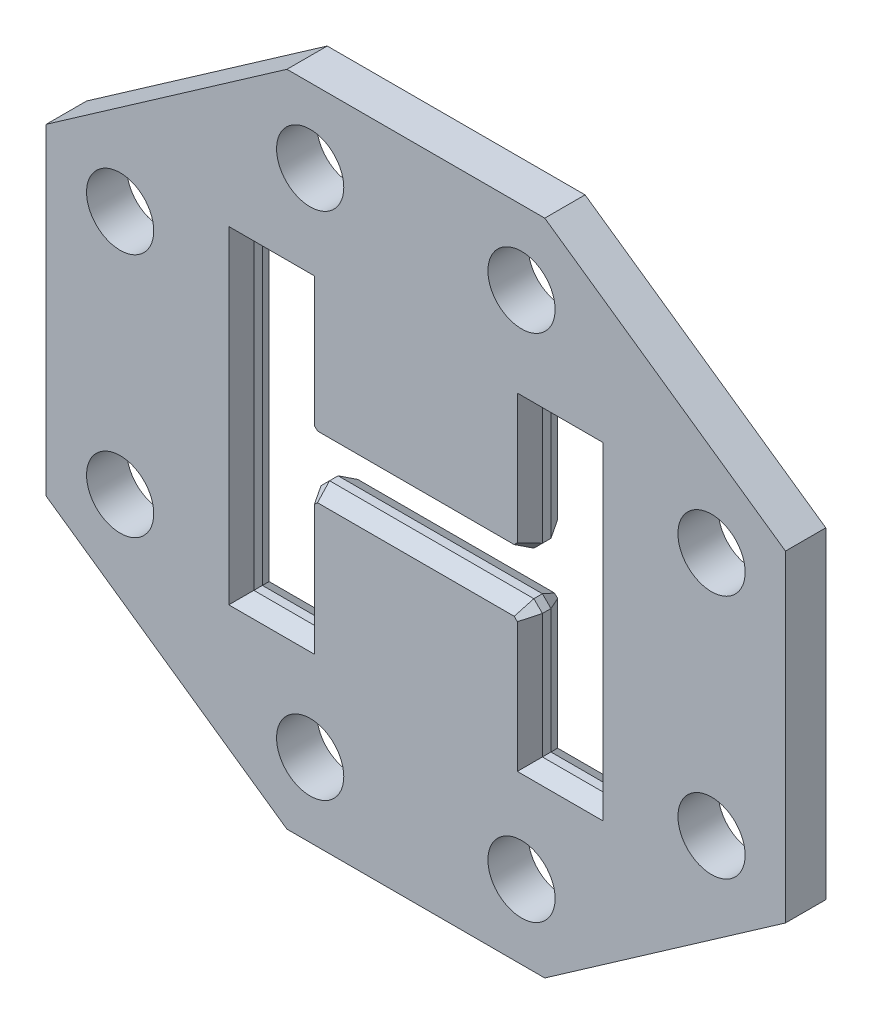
ISO-10303-21;
HEADER;
FILE_DESCRIPTION(('STEP AP214'),'2;1');
FILE_NAME('part.step','',(''),(''),'','','');
FILE_SCHEMA(('AUTOMOTIVE_DESIGN { 1 0 10303 214 1 1 1 1 }'));
ENDSEC;
DATA;
#1=APPLICATION_CONTEXT('core data for automotive mechanical design processes');
#2=APPLICATION_PROTOCOL_DEFINITION('international standard','automotive_design',2000,#1);
#3=PRODUCT_CONTEXT('',#1,'mechanical');
#4=PRODUCT('Part','Part','',(#3));
#5=PRODUCT_RELATED_PRODUCT_CATEGORY('part','',(#4));
#6=PRODUCT_DEFINITION_FORMATION('','',#4);
#7=PRODUCT_DEFINITION_CONTEXT('part definition',#1,'design');
#8=PRODUCT_DEFINITION('design','',#6,#7);
#9=PRODUCT_DEFINITION_SHAPE('','',#8);
#10=(LENGTH_UNIT() NAMED_UNIT(*) SI_UNIT(.MILLI.,.METRE.));
#11=(NAMED_UNIT(*) PLANE_ANGLE_UNIT() SI_UNIT($,.RADIAN.));
#12=(NAMED_UNIT(*) SI_UNIT($,.STERADIAN.) SOLID_ANGLE_UNIT());
#13=UNCERTAINTY_MEASURE_WITH_UNIT(LENGTH_MEASURE(1.E-05),#10,'distance_accuracy_value','');
#14=(GEOMETRIC_REPRESENTATION_CONTEXT(3) GLOBAL_UNCERTAINTY_ASSIGNED_CONTEXT((#13)) GLOBAL_UNIT_ASSIGNED_CONTEXT((#10,
#11,#12)) REPRESENTATION_CONTEXT('',''));
#15=CARTESIAN_POINT('',(0.,0.,0.));
#16=DIRECTION('',(0.,0.,1.));
#17=DIRECTION('',(1.,0.,0.));
#18=AXIS2_PLACEMENT_3D('',#15,#16,#17);
#19=CARTESIAN_POINT('',(156.845,-230.378,28.575));
#20=DIRECTION('',(1.,0.,0.));
#21=DIRECTION('',(0.,0.,-1.));
#22=AXIS2_PLACEMENT_3D('',#19,#20,#21);
#23=PLANE('',#22);
#24=DIRECTION('',(0.,0.,-1.));
#25=VECTOR('',#24,1.);
#26=CARTESIAN_POINT('',(156.845,-219.201999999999,28.575));
#27=LINE('',#26,#25);
#28=CARTESIAN_POINT('',(156.845,-219.201999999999,6.05833950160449));
#29=VERTEX_POINT('',#28);
#30=CARTESIAN_POINT('',(156.845,-219.201999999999,-6.05833950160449));
#31=VERTEX_POINT('',#30);
#32=EDGE_CURVE('E704',#29,#31,#27,.T.);
#33=ORIENTED_EDGE('',*,*,#32,.T.);
#34=DIRECTION('',(0.,1.,0.));
#35=VECTOR('',#34,1.);
#36=CARTESIAN_POINT('',(156.845,-230.378,-6.05833950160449));
#37=LINE('',#36,#35);
#38=CARTESIAN_POINT('',(156.845,-43.0529999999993,-6.05833950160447));
#39=VERTEX_POINT('',#38);
#40=EDGE_CURVE('E58',#31,#39,#37,.T.);
#41=ORIENTED_EDGE('',*,*,#40,.T.);
#42=DIRECTION('',(0.,0.,-1.));
#43=VECTOR('',#42,1.);
#44=CARTESIAN_POINT('',(156.845,-43.0529999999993,28.575));
#45=LINE('',#44,#43);
#46=CARTESIAN_POINT('',(156.845,-43.0529999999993,6.05833950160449));
#47=VERTEX_POINT('',#46);
#48=EDGE_CURVE('E709',#47,#39,#45,.T.);
#49=ORIENTED_EDGE('',*,*,#48,.F.);
#50=DIRECTION('',(0.,-1.,0.));
#51=VECTOR('',#50,1.);
#52=CARTESIAN_POINT('',(156.845,-219.201999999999,6.05833950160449));
#53=LINE('',#52,#51);
#54=EDGE_CURVE('E439',#47,#29,#53,.T.);
#55=ORIENTED_EDGE('',*,*,#54,.T.);
#56=EDGE_LOOP('',(#33,#41,#49,#55));
#57=FACE_BOUND('',#56,.T.);
#58=ADVANCED_FACE('F47',(#57),#23,.T.);
#59=CARTESIAN_POINT('',(-156.845,230.378,28.575));
#60=DIRECTION('',(-1.,0.,0.));
#61=DIRECTION('',(0.,0.,1.));
#62=AXIS2_PLACEMENT_3D('',#59,#60,#61);
#63=PLANE('',#62);
#64=DIRECTION('',(0.,0.,-1.));
#65=VECTOR('',#64,1.);
#66=CARTESIAN_POINT('',(-156.845,219.202000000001,28.575));
#67=LINE('',#66,#65);
#68=CARTESIAN_POINT('',(-156.845,219.202000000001,6.05833950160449));
#69=VERTEX_POINT('',#68);
#70=CARTESIAN_POINT('',(-156.845,219.202000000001,-6.05833950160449));
#71=VERTEX_POINT('',#70);
#72=EDGE_CURVE('E731',#69,#71,#67,.T.);
#73=ORIENTED_EDGE('',*,*,#72,.T.);
#74=DIRECTION('',(0.,-1.,0.));
#75=VECTOR('',#74,1.);
#76=CARTESIAN_POINT('',(-156.845,230.378,-6.05833950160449));
#77=LINE('',#76,#75);
#78=CARTESIAN_POINT('',(-156.845,43.0530000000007,-6.05833950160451));
#79=VERTEX_POINT('',#78);
#80=EDGE_CURVE('E573',#71,#79,#77,.T.);
#81=ORIENTED_EDGE('',*,*,#80,.T.);
#82=DIRECTION('',(0.,0.,-1.));
#83=VECTOR('',#82,1.);
#84=CARTESIAN_POINT('',(-156.845,43.0530000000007,28.575));
#85=LINE('',#84,#83);
#86=CARTESIAN_POINT('',(-156.845,43.0530000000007,6.05833950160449));
#87=VERTEX_POINT('',#86);
#88=EDGE_CURVE('E739',#87,#79,#85,.T.);
#89=ORIENTED_EDGE('',*,*,#88,.F.);
#90=DIRECTION('',(0.,1.,0.));
#91=VECTOR('',#90,1.);
#92=CARTESIAN_POINT('',(-156.845,219.202000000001,6.05833950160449));
#93=LINE('',#92,#91);
#94=EDGE_CURVE('E418',#87,#69,#93,.T.);
#95=ORIENTED_EDGE('',*,*,#94,.T.);
#96=EDGE_LOOP('',(#73,#81,#89,#95));
#97=FACE_BOUND('',#96,.T.);
#98=ADVANCED_FACE('F833',(#97),#63,.T.);
#99=CARTESIAN_POINT('',(0.,0.,28.575));
#100=DIRECTION('',(0.,0.,-1.));
#101=DIRECTION('',(-1.,0.,0.));
#102=AXIS2_PLACEMENT_3D('',#99,#100,#101);
#103=PLANE('',#102);
#104=DIRECTION('',(0.,-1.,0.));
#105=VECTOR('',#104,1.);
#106=CARTESIAN_POINT('',(265.095,-219.201999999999,28.575));
#107=LINE('',#106,#105);
#108=CARTESIAN_POINT('',(265.095,232.202000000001,28.575));
#109=VERTEX_POINT('',#108);
#110=CARTESIAN_POINT('',(265.095,-232.201999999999,28.575));
#111=VERTEX_POINT('',#110);
#112=EDGE_CURVE('E392',#109,#111,#107,.T.);
#113=ORIENTED_EDGE('',*,*,#112,.T.);
#114=DIRECTION('',(-1.,0.,0.));
#115=VECTOR('',#114,1.);
#116=CARTESIAN_POINT('',(156.845,-232.201999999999,28.575));
#117=LINE('',#116,#115);
#118=CARTESIAN_POINT('',(143.845,-232.201999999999,28.575));
#119=VERTEX_POINT('',#118);
#120=EDGE_CURVE('E394',#111,#119,#117,.T.);
#121=ORIENTED_EDGE('',*,*,#120,.T.);
#122=DIRECTION('',(0.,1.,0.));
#123=VECTOR('',#122,1.);
#124=CARTESIAN_POINT('',(143.845,-43.0529999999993,28.575));
#125=LINE('',#124,#123);
#126=CARTESIAN_POINT('',(143.845,-48.4377763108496,28.575));
#127=VERTEX_POINT('',#126);
#128=EDGE_CURVE('E345',#119,#127,#125,.T.);
#129=ORIENTED_EDGE('',*,*,#128,.T.);
#130=DIRECTION('',(-0.707106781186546,0.707106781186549,0.));
#131=VECTOR('',#130,1.);
#132=CARTESIAN_POINT('',(135.587611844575,-40.1803881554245,28.575));
#133=LINE('',#132,#131);
#134=CARTESIAN_POINT('',(139.39522368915,-43.9879999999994,28.575));
#135=VERTEX_POINT('',#134);
#136=EDGE_CURVE('E355',#127,#135,#133,.T.);
#137=ORIENTED_EDGE('',*,*,#136,.T.);
#138=DIRECTION('',(-1.,0.,0.));
#139=VECTOR('',#138,1.);
#140=CARTESIAN_POINT('',(-144.78,-43.9879999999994,28.575));
#141=LINE('',#140,#139);
#142=CARTESIAN_POINT('',(-139.39522368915,-43.9879999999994,28.575));
#143=VERTEX_POINT('',#142);
#144=EDGE_CURVE('E354',#135,#143,#141,.T.);
#145=ORIENTED_EDGE('',*,*,#144,.T.);
#146=DIRECTION('',(-0.707106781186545,-0.70710678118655,0.));
#147=VECTOR('',#146,1.);
#148=CARTESIAN_POINT('',(-147.652611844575,-52.2453881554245,28.575));
#149=LINE('',#148,#147);
#150=CARTESIAN_POINT('',(-143.845,-48.4377763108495,28.575));
#151=VERTEX_POINT('',#150);
#152=EDGE_CURVE('E356',#143,#151,#149,.T.);
#153=ORIENTED_EDGE('',*,*,#152,.T.);
#154=DIRECTION('',(0.,-1.,0.));
#155=VECTOR('',#154,1.);
#156=CARTESIAN_POINT('',(-143.845,-219.201999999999,28.575));
#157=LINE('',#156,#155);
#158=CARTESIAN_POINT('',(-143.845,-232.201999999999,28.575));
#159=VERTEX_POINT('',#158);
#160=EDGE_CURVE('E363',#151,#159,#157,.T.);
#161=ORIENTED_EDGE('',*,*,#160,.T.);
#162=DIRECTION('',(-1.,0.,0.));
#163=VECTOR('',#162,1.);
#164=CARTESIAN_POINT('',(-252.095,-232.201999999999,28.575));
#165=LINE('',#164,#163);
#166=CARTESIAN_POINT('',(-265.095,-232.201999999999,28.575));
#167=VERTEX_POINT('',#166);
#168=EDGE_CURVE('E364',#159,#167,#165,.T.);
#169=ORIENTED_EDGE('',*,*,#168,.T.);
#170=DIRECTION('',(0.,1.,0.));
#171=VECTOR('',#170,1.);
#172=CARTESIAN_POINT('',(-265.095,219.202000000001,28.575));
#173=LINE('',#172,#171);
#174=CARTESIAN_POINT('',(-265.095,232.202000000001,28.575));
#175=VERTEX_POINT('',#174);
#176=EDGE_CURVE('E370',#167,#175,#173,.T.);
#177=ORIENTED_EDGE('',*,*,#176,.T.);
#178=DIRECTION('',(1.,0.,0.));
#179=VECTOR('',#178,1.);
#180=CARTESIAN_POINT('',(-156.845,232.202000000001,28.575));
#181=LINE('',#180,#179);
#182=CARTESIAN_POINT('',(-143.845,232.202000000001,28.575));
#183=VERTEX_POINT('',#182);
#184=EDGE_CURVE('E369',#175,#183,#181,.T.);
#185=ORIENTED_EDGE('',*,*,#184,.T.);
#186=DIRECTION('',(0.,-1.,0.));
#187=VECTOR('',#186,1.);
#188=CARTESIAN_POINT('',(-143.845,43.0530000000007,28.575));
#189=LINE('',#188,#187);
#190=CARTESIAN_POINT('',(-143.845,48.4377763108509,28.575));
#191=VERTEX_POINT('',#190);
#192=EDGE_CURVE('E373',#183,#191,#189,.T.);
#193=ORIENTED_EDGE('',*,*,#192,.T.);
#194=DIRECTION('',(0.707106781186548,-0.707106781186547,0.));
#195=VECTOR('',#194,1.);
#196=CARTESIAN_POINT('',(-135.587611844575,40.1803881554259,28.575));
#197=LINE('',#196,#195);
#198=CARTESIAN_POINT('',(-139.39522368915,43.9880000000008,28.575));
#199=VERTEX_POINT('',#198);
#200=EDGE_CURVE('E376',#191,#199,#197,.T.);
#201=ORIENTED_EDGE('',*,*,#200,.T.);
#202=DIRECTION('',(1.,0.,0.));
#203=VECTOR('',#202,1.);
#204=CARTESIAN_POINT('',(144.78,43.9880000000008,28.575));
#205=LINE('',#204,#203);
#206=CARTESIAN_POINT('',(139.39522368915,43.9880000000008,28.575));
#207=VERTEX_POINT('',#206);
#208=EDGE_CURVE('E378',#199,#207,#205,.T.);
#209=ORIENTED_EDGE('',*,*,#208,.T.);
#210=DIRECTION('',(0.707106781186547,0.707106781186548,0.));
#211=VECTOR('',#210,1.);
#212=CARTESIAN_POINT('',(147.652611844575,52.2453881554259,28.575));
#213=LINE('',#212,#211);
#214=CARTESIAN_POINT('',(143.845,48.437776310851,28.575));
#215=VERTEX_POINT('',#214);
#216=EDGE_CURVE('E385',#207,#215,#213,.T.);
#217=ORIENTED_EDGE('',*,*,#216,.T.);
#218=DIRECTION('',(0.,1.,0.));
#219=VECTOR('',#218,1.);
#220=CARTESIAN_POINT('',(143.845,219.202000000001,28.575));
#221=LINE('',#220,#219);
#222=CARTESIAN_POINT('',(143.845,232.202000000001,28.575));
#223=VERTEX_POINT('',#222);
#224=EDGE_CURVE('E383',#215,#223,#221,.T.);
#225=ORIENTED_EDGE('',*,*,#224,.T.);
#226=DIRECTION('',(1.,0.,0.));
#227=VECTOR('',#226,1.);
#228=CARTESIAN_POINT('',(252.095,232.202000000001,28.575));
#229=LINE('',#228,#227);
#230=EDGE_CURVE('E387',#223,#109,#229,.T.);
#231=ORIENTED_EDGE('',*,*,#230,.T.);
#232=EDGE_LOOP('',(#113,#121,#129,#137,#145,#153,#161,#169,#177,#185,#193,#201,#209,#217,#225,#231));
#233=FACE_BOUND('',#232,.T.);
#234=CARTESIAN_POINT('',(-149.758610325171,-361.549268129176,28.575));
#235=DIRECTION('',(0.,0.,1.));
#236=DIRECTION('',(1.,0.,0.));
#237=AXIS2_PLACEMENT_3D('',#234,#235,#236);
#238=CIRCLE('',#237,47.625);
#239=CARTESIAN_POINT('',(-102.133610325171,-361.549268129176,28.575));
#240=VERTEX_POINT('',#239);
#241=EDGE_CURVE('E1667',#240,#240,#238,.T.);
#242=ORIENTED_EDGE('',*,*,#241,.F.);
#243=EDGE_LOOP('',(#242));
#244=FACE_BOUND('',#243,.T.);
#245=CARTESIAN_POINT('',(149.758610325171,-361.549268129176,28.575));
#246=DIRECTION('',(0.,0.,1.));
#247=DIRECTION('',(1.,0.,0.));
#248=AXIS2_PLACEMENT_3D('',#245,#246,#247);
#249=CIRCLE('',#248,47.625);
#250=CARTESIAN_POINT('',(197.383610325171,-361.549268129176,28.575));
#251=VERTEX_POINT('',#250);
#252=EDGE_CURVE('E1673',#251,#251,#249,.T.);
#253=ORIENTED_EDGE('',*,*,#252,.F.);
#254=EDGE_LOOP('',(#253));
#255=FACE_BOUND('',#254,.T.);
#256=CARTESIAN_POINT('',(419.080268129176,-173.588730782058,28.575));
#257=DIRECTION('',(0.,0.,1.));
#258=DIRECTION('',(1.,0.,0.));
#259=AXIS2_PLACEMENT_3D('',#256,#257,#258);
#260=CIRCLE('',#259,47.625);
#261=CARTESIAN_POINT('',(466.705268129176,-173.588730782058,28.575));
#262=VERTEX_POINT('',#261);
#263=EDGE_CURVE('E1680',#262,#262,#260,.T.);
#264=ORIENTED_EDGE('',*,*,#263,.F.);
#265=EDGE_LOOP('',(#264));
#266=FACE_BOUND('',#265,.T.);
#267=CARTESIAN_POINT('',(419.080268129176,173.588730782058,28.575));
#268=DIRECTION('',(0.,0.,1.));
#269=DIRECTION('',(1.,0.,0.));
#270=AXIS2_PLACEMENT_3D('',#267,#268,#269);
#271=CIRCLE('',#270,47.625);
#272=CARTESIAN_POINT('',(466.705268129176,173.588730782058,28.575));
#273=VERTEX_POINT('',#272);
#274=EDGE_CURVE('E1682',#273,#273,#271,.T.);
#275=ORIENTED_EDGE('',*,*,#274,.F.);
#276=EDGE_LOOP('',(#275));
#277=FACE_BOUND('',#276,.T.);
#278=CARTESIAN_POINT('',(149.758610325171,361.549268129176,28.575));
#279=DIRECTION('',(0.,0.,1.));
#280=DIRECTION('',(1.,0.,0.));
#281=AXIS2_PLACEMENT_3D('',#278,#279,#280);
#282=CIRCLE('',#281,47.625);
#283=CARTESIAN_POINT('',(197.383610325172,361.549268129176,28.575));
#284=VERTEX_POINT('',#283);
#285=EDGE_CURVE('E1683',#284,#284,#282,.T.);
#286=ORIENTED_EDGE('',*,*,#285,.F.);
#287=EDGE_LOOP('',(#286));
#288=FACE_BOUND('',#287,.T.);
#289=CARTESIAN_POINT('',(-149.758610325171,361.549268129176,28.575));
#290=DIRECTION('',(0.,0.,1.));
#291=DIRECTION('',(1.,0.,0.));
#292=AXIS2_PLACEMENT_3D('',#289,#290,#291);
#293=CIRCLE('',#292,47.625);
#294=CARTESIAN_POINT('',(-102.133610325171,361.549268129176,28.575));
#295=VERTEX_POINT('',#294);
#296=EDGE_CURVE('E1690',#295,#295,#293,.T.);
#297=ORIENTED_EDGE('',*,*,#296,.F.);
#298=EDGE_LOOP('',(#297));
#299=FACE_BOUND('',#298,.T.);
#300=CARTESIAN_POINT('',(-419.080268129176,173.588730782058,28.575));
#301=DIRECTION('',(0.,0.,1.));
#302=DIRECTION('',(1.,0.,0.));
#303=AXIS2_PLACEMENT_3D('',#300,#301,#302);
#304=CIRCLE('',#303,47.625);
#305=CARTESIAN_POINT('',(-371.455268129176,173.588730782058,28.575));
#306=VERTEX_POINT('',#305);
#307=EDGE_CURVE('E1693',#306,#306,#304,.T.);
#308=ORIENTED_EDGE('',*,*,#307,.F.);
#309=EDGE_LOOP('',(#308));
#310=FACE_BOUND('',#309,.T.);
#311=CARTESIAN_POINT('',(-419.080268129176,-173.588730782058,28.575));
#312=DIRECTION('',(0.,0.,1.));
#313=DIRECTION('',(1.,0.,0.));
#314=AXIS2_PLACEMENT_3D('',#311,#312,#313);
#315=CIRCLE('',#314,47.625);
#316=CARTESIAN_POINT('',(-371.455268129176,-173.588730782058,28.575));
#317=VERTEX_POINT('',#316);
#318=EDGE_CURVE('E1698',#317,#317,#315,.T.);
#319=ORIENTED_EDGE('',*,*,#318,.F.);
#320=EDGE_LOOP('',(#319));
#321=FACE_BOUND('',#320,.T.);
#322=DIRECTION('',(0.,-1.,0.));
#323=VECTOR('',#322,1.);
#324=CARTESIAN_POINT('',(-523.855268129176,-228.234235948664,28.575));
#325=LINE('',#324,#323);
#326=CARTESIAN_POINT('',(-523.855268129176,228.234235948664,28.575));
#327=VERTEX_POINT('',#326);
#328=CARTESIAN_POINT('',(-523.855268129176,-228.234235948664,28.575));
#329=VERTEX_POINT('',#328);
#330=EDGE_CURVE('E322',#327,#329,#325,.T.);
#331=ORIENTED_EDGE('',*,*,#330,.T.);
#332=DIRECTION('',(0.820038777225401,-0.572307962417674,0.));
#333=VECTOR('',#332,1.);
#334=CARTESIAN_POINT('',(-182.70492307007,-466.324268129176,28.575));
#335=LINE('',#334,#333);
#336=CARTESIAN_POINT('',(-182.70492307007,-466.324268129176,28.575));
#337=VERTEX_POINT('',#336);
#338=EDGE_CURVE('E311',#329,#337,#335,.T.);
#339=ORIENTED_EDGE('',*,*,#338,.T.);
#340=DIRECTION('',(1.,0.,0.));
#341=VECTOR('',#340,1.);
#342=CARTESIAN_POINT('',(182.70492307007,-466.324268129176,28.575));
#343=LINE('',#342,#341);
#344=CARTESIAN_POINT('',(182.70492307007,-466.324268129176,28.575));
#345=VERTEX_POINT('',#344);
#346=EDGE_CURVE('E324',#337,#345,#343,.T.);
#347=ORIENTED_EDGE('',*,*,#346,.T.);
#348=DIRECTION('',(0.820038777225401,0.572307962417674,0.));
#349=VECTOR('',#348,1.);
#350=CARTESIAN_POINT('',(523.855268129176,-228.234235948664,28.575));
#351=LINE('',#350,#349);
#352=CARTESIAN_POINT('',(523.855268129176,-228.234235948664,28.575));
#353=VERTEX_POINT('',#352);
#354=EDGE_CURVE('E744',#345,#353,#351,.T.);
#355=ORIENTED_EDGE('',*,*,#354,.T.);
#356=DIRECTION('',(0.,1.,0.));
#357=VECTOR('',#356,1.);
#358=CARTESIAN_POINT('',(523.855268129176,228.234235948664,28.575));
#359=LINE('',#358,#357);
#360=CARTESIAN_POINT('',(523.855268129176,228.234235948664,28.575));
#361=VERTEX_POINT('',#360);
#362=EDGE_CURVE('E746',#353,#361,#359,.T.);
#363=ORIENTED_EDGE('',*,*,#362,.T.);
#364=DIRECTION('',(-0.820038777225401,0.572307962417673,0.));
#365=VECTOR('',#364,1.);
#366=CARTESIAN_POINT('',(182.70492307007,466.324268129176,28.575));
#367=LINE('',#366,#365);
#368=CARTESIAN_POINT('',(182.70492307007,466.324268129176,28.575));
#369=VERTEX_POINT('',#368);
#370=EDGE_CURVE('E753',#361,#369,#367,.T.);
#371=ORIENTED_EDGE('',*,*,#370,.T.);
#372=DIRECTION('',(-1.,0.,0.));
#373=VECTOR('',#372,1.);
#374=CARTESIAN_POINT('',(-182.704923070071,466.324268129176,28.575));
#375=LINE('',#374,#373);
#376=CARTESIAN_POINT('',(-182.704923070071,466.324268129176,28.575));
#377=VERTEX_POINT('',#376);
#378=EDGE_CURVE('E754',#369,#377,#375,.T.);
#379=ORIENTED_EDGE('',*,*,#378,.T.);
#380=DIRECTION('',(-0.8200387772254,-0.572307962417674,0.));
#381=VECTOR('',#380,1.);
#382=CARTESIAN_POINT('',(-523.855268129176,228.234235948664,28.575));
#383=LINE('',#382,#381);
#384=EDGE_CURVE('E328',#377,#327,#383,.T.);
#385=ORIENTED_EDGE('',*,*,#384,.T.);
#386=EDGE_LOOP('',(#331,#339,#347,#355,#363,#371,#379,#385));
#387=FACE_BOUND('',#386,.T.);
#388=ADVANCED_FACE('F327',(#233,#244,#255,#266,#277,#288,#299,#310,#321,#387),#103,.F.);
#389=CARTESIAN_POINT('',(0.,0.,-28.575));
#390=DIRECTION('',(0.,0.,-1.));
#391=DIRECTION('',(-1.,0.,0.));
#392=AXIS2_PLACEMENT_3D('',#389,#390,#391);
#393=PLANE('',#392);
#394=DIRECTION('',(0.707106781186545,0.70710678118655,0.));
#395=VECTOR('',#394,1.);
#396=CARTESIAN_POINT('',(-47.7036118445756,47.7036118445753,-28.575));
#397=LINE('',#396,#395);
#398=CARTESIAN_POINT('',(-143.845,-48.4377763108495,-28.575));
#399=VERTEX_POINT('',#398);
#400=CARTESIAN_POINT('',(-139.39522368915,-43.9879999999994,-28.575));
#401=VERTEX_POINT('',#400);
#402=EDGE_CURVE('E546',#399,#401,#397,.T.);
#403=ORIENTED_EDGE('',*,*,#402,.T.);
#404=DIRECTION('',(1.,0.,0.));
#405=VECTOR('',#404,1.);
#406=CARTESIAN_POINT('',(0.,-43.9879999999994,-28.575));
#407=LINE('',#406,#405);
#408=CARTESIAN_POINT('',(139.39522368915,-43.9879999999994,-28.575));
#409=VERTEX_POINT('',#408);
#410=EDGE_CURVE('E553',#401,#409,#407,.T.);
#411=ORIENTED_EDGE('',*,*,#410,.T.);
#412=DIRECTION('',(0.707106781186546,-0.707106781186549,0.));
#413=VECTOR('',#412,1.);
#414=CARTESIAN_POINT('',(47.7036118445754,47.7036118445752,-28.575));
#415=LINE('',#414,#413);
#416=CARTESIAN_POINT('',(143.845,-48.4377763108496,-28.575));
#417=VERTEX_POINT('',#416);
#418=EDGE_CURVE('E442',#409,#417,#415,.T.);
#419=ORIENTED_EDGE('',*,*,#418,.T.);
#420=DIRECTION('',(0.,-1.,0.));
#421=VECTOR('',#420,1.);
#422=CARTESIAN_POINT('',(143.845,0.,-28.575));
#423=LINE('',#422,#421);
#424=CARTESIAN_POINT('',(143.845,-232.201999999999,-28.575));
#425=VERTEX_POINT('',#424);
#426=EDGE_CURVE('E508',#417,#425,#423,.T.);
#427=ORIENTED_EDGE('',*,*,#426,.T.);
#428=DIRECTION('',(1.,0.,0.));
#429=VECTOR('',#428,1.);
#430=CARTESIAN_POINT('',(0.,-232.201999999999,-28.575));
#431=LINE('',#430,#429);
#432=CARTESIAN_POINT('',(265.095,-232.201999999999,-28.575));
#433=VERTEX_POINT('',#432);
#434=EDGE_CURVE('E515',#425,#433,#431,.T.);
#435=ORIENTED_EDGE('',*,*,#434,.T.);
#436=DIRECTION('',(0.,1.,0.));
#437=VECTOR('',#436,1.);
#438=CARTESIAN_POINT('',(265.095,0.,-28.575));
#439=LINE('',#438,#437);
#440=CARTESIAN_POINT('',(265.095,232.202000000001,-28.575));
#441=VERTEX_POINT('',#440);
#442=EDGE_CURVE('E513',#433,#441,#439,.T.);
#443=ORIENTED_EDGE('',*,*,#442,.T.);
#444=DIRECTION('',(-1.,0.,0.));
#445=VECTOR('',#444,1.);
#446=CARTESIAN_POINT('',(0.,232.202000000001,-28.575));
#447=LINE('',#446,#445);
#448=CARTESIAN_POINT('',(143.845,232.202000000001,-28.575));
#449=VERTEX_POINT('',#448);
#450=EDGE_CURVE('E517',#441,#449,#447,.T.);
#451=ORIENTED_EDGE('',*,*,#450,.T.);
#452=DIRECTION('',(0.,-1.,0.));
#453=VECTOR('',#452,1.);
#454=CARTESIAN_POINT('',(143.845,0.,-28.575));
#455=LINE('',#454,#453);
#456=CARTESIAN_POINT('',(143.845,48.437776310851,-28.575));
#457=VERTEX_POINT('',#456);
#458=EDGE_CURVE('E522',#449,#457,#455,.T.);
#459=ORIENTED_EDGE('',*,*,#458,.T.);
#460=DIRECTION('',(-0.707106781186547,-0.707106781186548,0.));
#461=VECTOR('',#460,1.);
#462=CARTESIAN_POINT('',(47.7036118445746,-47.7036118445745,-28.575));
#463=LINE('',#462,#461);
#464=CARTESIAN_POINT('',(139.39522368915,43.9880000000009,-28.575));
#465=VERTEX_POINT('',#464);
#466=EDGE_CURVE('E524',#457,#465,#463,.T.);
#467=ORIENTED_EDGE('',*,*,#466,.T.);
#468=DIRECTION('',(-1.,0.,0.));
#469=VECTOR('',#468,1.);
#470=CARTESIAN_POINT('',(0.,43.9880000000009,-28.575));
#471=LINE('',#470,#469);
#472=CARTESIAN_POINT('',(-139.39522368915,43.9880000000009,-28.575));
#473=VERTEX_POINT('',#472);
#474=EDGE_CURVE('E530',#465,#473,#471,.T.);
#475=ORIENTED_EDGE('',*,*,#474,.T.);
#476=DIRECTION('',(-0.707106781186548,0.707106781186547,0.));
#477=VECTOR('',#476,1.);
#478=CARTESIAN_POINT('',(-47.7036118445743,-47.7036118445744,-28.575));
#479=LINE('',#478,#477);
#480=CARTESIAN_POINT('',(-143.845,48.4377763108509,-28.575));
#481=VERTEX_POINT('',#480);
#482=EDGE_CURVE('E529',#473,#481,#479,.T.);
#483=ORIENTED_EDGE('',*,*,#482,.T.);
#484=DIRECTION('',(0.,1.,0.));
#485=VECTOR('',#484,1.);
#486=CARTESIAN_POINT('',(-143.845,0.,-28.575));
#487=LINE('',#486,#485);
#488=CARTESIAN_POINT('',(-143.845,232.202000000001,-28.575));
#489=VERTEX_POINT('',#488);
#490=EDGE_CURVE('E531',#481,#489,#487,.T.);
#491=ORIENTED_EDGE('',*,*,#490,.T.);
#492=DIRECTION('',(-1.,0.,0.));
#493=VECTOR('',#492,1.);
#494=CARTESIAN_POINT('',(0.,232.202000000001,-28.575));
#495=LINE('',#494,#493);
#496=CARTESIAN_POINT('',(-265.095,232.202000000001,-28.575));
#497=VERTEX_POINT('',#496);
#498=EDGE_CURVE('E538',#489,#497,#495,.T.);
#499=ORIENTED_EDGE('',*,*,#498,.T.);
#500=DIRECTION('',(0.,-1.,0.));
#501=VECTOR('',#500,1.);
#502=CARTESIAN_POINT('',(-265.095,0.,-28.575));
#503=LINE('',#502,#501);
#504=CARTESIAN_POINT('',(-265.095,-232.201999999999,-28.575));
#505=VERTEX_POINT('',#504);
#506=EDGE_CURVE('E540',#497,#505,#503,.T.);
#507=ORIENTED_EDGE('',*,*,#506,.T.);
#508=DIRECTION('',(1.,0.,0.));
#509=VECTOR('',#508,1.);
#510=CARTESIAN_POINT('',(0.,-232.201999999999,-28.575));
#511=LINE('',#510,#509);
#512=CARTESIAN_POINT('',(-143.845,-232.201999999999,-28.575));
#513=VERTEX_POINT('',#512);
#514=EDGE_CURVE('E545',#505,#513,#511,.T.);
#515=ORIENTED_EDGE('',*,*,#514,.T.);
#516=DIRECTION('',(0.,1.,0.));
#517=VECTOR('',#516,1.);
#518=CARTESIAN_POINT('',(-143.845,0.,-28.575));
#519=LINE('',#518,#517);
#520=EDGE_CURVE('E541',#513,#399,#519,.T.);
#521=ORIENTED_EDGE('',*,*,#520,.T.);
#522=EDGE_LOOP('',(#403,#411,#419,#427,#435,#443,#451,#459,#467,#475,#483,#491,#499,#507,#515,#521));
#523=FACE_BOUND('',#522,.T.);
#524=CARTESIAN_POINT('',(-149.758610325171,-361.549268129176,-28.575));
#525=DIRECTION('',(0.,0.,1.));
#526=DIRECTION('',(1.,0.,0.));
#527=AXIS2_PLACEMENT_3D('',#524,#525,#526);
#528=CIRCLE('',#527,47.625);
#529=CARTESIAN_POINT('',(-102.133610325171,-361.549268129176,-28.575));
#530=VERTEX_POINT('',#529);
#531=EDGE_CURVE('E506',#530,#530,#528,.T.);
#532=ORIENTED_EDGE('',*,*,#531,.T.);
#533=EDGE_LOOP('',(#532));
#534=FACE_BOUND('',#533,.T.);
#535=CARTESIAN_POINT('',(149.758610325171,-361.549268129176,-28.575));
#536=DIRECTION('',(0.,0.,1.));
#537=DIRECTION('',(1.,0.,0.));
#538=AXIS2_PLACEMENT_3D('',#535,#536,#537);
#539=CIRCLE('',#538,47.625);
#540=CARTESIAN_POINT('',(197.383610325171,-361.549268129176,-28.575));
#541=VERTEX_POINT('',#540);
#542=EDGE_CURVE('E1707',#541,#541,#539,.T.);
#543=ORIENTED_EDGE('',*,*,#542,.T.);
#544=EDGE_LOOP('',(#543));
#545=FACE_BOUND('',#544,.T.);
#546=CARTESIAN_POINT('',(419.080268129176,-173.588730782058,-28.575));
#547=DIRECTION('',(0.,0.,1.));
#548=DIRECTION('',(1.,0.,0.));
#549=AXIS2_PLACEMENT_3D('',#546,#547,#548);
#550=CIRCLE('',#549,47.625);
#551=CARTESIAN_POINT('',(466.705268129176,-173.588730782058,-28.575));
#552=VERTEX_POINT('',#551);
#553=EDGE_CURVE('E1714',#552,#552,#550,.T.);
#554=ORIENTED_EDGE('',*,*,#553,.T.);
#555=EDGE_LOOP('',(#554));
#556=FACE_BOUND('',#555,.T.);
#557=CARTESIAN_POINT('',(419.080268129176,173.588730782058,-28.575));
#558=DIRECTION('',(0.,0.,1.));
#559=DIRECTION('',(1.,0.,0.));
#560=AXIS2_PLACEMENT_3D('',#557,#558,#559);
#561=CIRCLE('',#560,47.625);
#562=CARTESIAN_POINT('',(466.705268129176,173.588730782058,-28.575));
#563=VERTEX_POINT('',#562);
#564=EDGE_CURVE('E1719',#563,#563,#561,.T.);
#565=ORIENTED_EDGE('',*,*,#564,.T.);
#566=EDGE_LOOP('',(#565));
#567=FACE_BOUND('',#566,.T.);
#568=CARTESIAN_POINT('',(149.758610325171,361.549268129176,-28.575));
#569=DIRECTION('',(0.,0.,1.));
#570=DIRECTION('',(1.,0.,0.));
#571=AXIS2_PLACEMENT_3D('',#568,#569,#570);
#572=CIRCLE('',#571,47.625);
#573=CARTESIAN_POINT('',(197.383610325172,361.549268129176,-28.575));
#574=VERTEX_POINT('',#573);
#575=EDGE_CURVE('E1728',#574,#574,#572,.T.);
#576=ORIENTED_EDGE('',*,*,#575,.T.);
#577=EDGE_LOOP('',(#576));
#578=FACE_BOUND('',#577,.T.);
#579=CARTESIAN_POINT('',(-149.758610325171,361.549268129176,-28.575));
#580=DIRECTION('',(0.,0.,1.));
#581=DIRECTION('',(1.,0.,0.));
#582=AXIS2_PLACEMENT_3D('',#579,#580,#581);
#583=CIRCLE('',#582,47.625);
#584=CARTESIAN_POINT('',(-102.133610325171,361.549268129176,-28.575));
#585=VERTEX_POINT('',#584);
#586=EDGE_CURVE('E1735',#585,#585,#583,.T.);
#587=ORIENTED_EDGE('',*,*,#586,.T.);
#588=EDGE_LOOP('',(#587));
#589=FACE_BOUND('',#588,.T.);
#590=CARTESIAN_POINT('',(-419.080268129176,173.588730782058,-28.575));
#591=DIRECTION('',(0.,0.,1.));
#592=DIRECTION('',(1.,0.,0.));
#593=AXIS2_PLACEMENT_3D('',#590,#591,#592);
#594=CIRCLE('',#593,47.625);
#595=CARTESIAN_POINT('',(-371.455268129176,173.588730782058,-28.575));
#596=VERTEX_POINT('',#595);
#597=EDGE_CURVE('E1701',#596,#596,#594,.T.);
#598=ORIENTED_EDGE('',*,*,#597,.T.);
#599=EDGE_LOOP('',(#598));
#600=FACE_BOUND('',#599,.T.);
#601=CARTESIAN_POINT('',(-419.080268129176,-173.588730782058,-28.575));
#602=DIRECTION('',(0.,0.,1.));
#603=DIRECTION('',(1.,0.,0.));
#604=AXIS2_PLACEMENT_3D('',#601,#602,#603);
#605=CIRCLE('',#604,47.625);
#606=CARTESIAN_POINT('',(-371.455268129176,-173.588730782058,-28.575));
#607=VERTEX_POINT('',#606);
#608=EDGE_CURVE('E691',#607,#607,#605,.T.);
#609=ORIENTED_EDGE('',*,*,#608,.T.);
#610=EDGE_LOOP('',(#609));
#611=FACE_BOUND('',#610,.T.);
#612=DIRECTION('',(0.,-1.,0.));
#613=VECTOR('',#612,1.);
#614=CARTESIAN_POINT('',(-523.855268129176,-228.234235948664,-28.575));
#615=LINE('',#614,#613);
#616=CARTESIAN_POINT('',(-523.855268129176,228.234235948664,-28.575));
#617=VERTEX_POINT('',#616);
#618=CARTESIAN_POINT('',(-523.855268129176,-228.234235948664,-28.575));
#619=VERTEX_POINT('',#618);
#620=EDGE_CURVE('E340',#617,#619,#615,.T.);
#621=ORIENTED_EDGE('',*,*,#620,.F.);
#622=DIRECTION('',(-0.8200387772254,-0.572307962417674,0.));
#623=VECTOR('',#622,1.);
#624=CARTESIAN_POINT('',(-523.855268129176,228.234235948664,-28.575));
#625=LINE('',#624,#623);
#626=CARTESIAN_POINT('',(-182.704923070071,466.324268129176,-28.575));
#627=VERTEX_POINT('',#626);
#628=EDGE_CURVE('E331',#627,#617,#625,.T.);
#629=ORIENTED_EDGE('',*,*,#628,.F.);
#630=DIRECTION('',(-1.,0.,0.));
#631=VECTOR('',#630,1.);
#632=CARTESIAN_POINT('',(-182.704923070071,466.324268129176,-28.575));
#633=LINE('',#632,#631);
#634=CARTESIAN_POINT('',(182.70492307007,466.324268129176,-28.575));
#635=VERTEX_POINT('',#634);
#636=EDGE_CURVE('E779',#635,#627,#633,.T.);
#637=ORIENTED_EDGE('',*,*,#636,.F.);
#638=DIRECTION('',(-0.820038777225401,0.572307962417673,0.));
#639=VECTOR('',#638,1.);
#640=CARTESIAN_POINT('',(182.70492307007,466.324268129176,-28.575));
#641=LINE('',#640,#639);
#642=CARTESIAN_POINT('',(523.855268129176,228.234235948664,-28.575));
#643=VERTEX_POINT('',#642);
#644=EDGE_CURVE('E771',#643,#635,#641,.T.);
#645=ORIENTED_EDGE('',*,*,#644,.F.);
#646=DIRECTION('',(0.,1.,0.));
#647=VECTOR('',#646,1.);
#648=CARTESIAN_POINT('',(523.855268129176,228.234235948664,-28.575));
#649=LINE('',#648,#647);
#650=CARTESIAN_POINT('',(523.855268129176,-228.234235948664,-28.575));
#651=VERTEX_POINT('',#650);
#652=EDGE_CURVE('E772',#651,#643,#649,.T.);
#653=ORIENTED_EDGE('',*,*,#652,.F.);
#654=DIRECTION('',(0.820038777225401,0.572307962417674,0.));
#655=VECTOR('',#654,1.);
#656=CARTESIAN_POINT('',(523.855268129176,-228.234235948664,-28.575));
#657=LINE('',#656,#655);
#658=CARTESIAN_POINT('',(182.70492307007,-466.324268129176,-28.575));
#659=VERTEX_POINT('',#658);
#660=EDGE_CURVE('E767',#659,#651,#657,.T.);
#661=ORIENTED_EDGE('',*,*,#660,.F.);
#662=DIRECTION('',(1.,0.,0.));
#663=VECTOR('',#662,1.);
#664=CARTESIAN_POINT('',(182.70492307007,-466.324268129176,-28.575));
#665=LINE('',#664,#663);
#666=CARTESIAN_POINT('',(-182.70492307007,-466.324268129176,-28.575));
#667=VERTEX_POINT('',#666);
#668=EDGE_CURVE('E764',#667,#659,#665,.T.);
#669=ORIENTED_EDGE('',*,*,#668,.F.);
#670=DIRECTION('',(0.820038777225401,-0.572307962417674,0.));
#671=VECTOR('',#670,1.);
#672=CARTESIAN_POINT('',(-182.70492307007,-466.324268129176,-28.575));
#673=LINE('',#672,#671);
#674=EDGE_CURVE('E765',#619,#667,#673,.T.);
#675=ORIENTED_EDGE('',*,*,#674,.F.);
#676=EDGE_LOOP('',(#621,#629,#637,#645,#653,#661,#669,#675));
#677=FACE_BOUND('',#676,.T.);
#678=ADVANCED_FACE('F813',(#523,#534,#545,#556,#567,#578,#589,#600,#611,#677),#393,.T.);
#679=CARTESIAN_POINT('',(-523.855268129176,-228.234235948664,28.575));
#680=DIRECTION('',(1.,0.,0.));
#681=DIRECTION('',(0.,0.,-1.));
#682=AXIS2_PLACEMENT_3D('',#679,#680,#681);
#683=PLANE('',#682);
#684=ORIENTED_EDGE('',*,*,#620,.T.);
#685=DIRECTION('',(0.,0.,-1.));
#686=VECTOR('',#685,1.);
#687=CARTESIAN_POINT('',(-523.855268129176,-228.234235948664,28.575));
#688=LINE('',#687,#686);
#689=EDGE_CURVE('E314',#329,#619,#688,.T.);
#690=ORIENTED_EDGE('',*,*,#689,.F.);
#691=ORIENTED_EDGE('',*,*,#330,.F.);
#692=DIRECTION('',(0.,0.,-1.));
#693=VECTOR('',#692,1.);
#694=CARTESIAN_POINT('',(-523.855268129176,228.234235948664,28.575));
#695=LINE('',#694,#693);
#696=EDGE_CURVE('E757',#327,#617,#695,.T.);
#697=ORIENTED_EDGE('',*,*,#696,.T.);
#698=EDGE_LOOP('',(#684,#690,#691,#697));
#699=FACE_BOUND('',#698,.T.);
#700=ADVANCED_FACE('F334',(#699),#683,.F.);
#701=CARTESIAN_POINT('',(-182.70492307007,-466.324268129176,28.575));
#702=DIRECTION('',(0.572307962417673,0.820038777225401,0.));
#703=DIRECTION('',(-0.820038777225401,0.572307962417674,0.));
#704=AXIS2_PLACEMENT_3D('',#701,#702,#703);
#705=PLANE('',#704);
#706=ORIENTED_EDGE('',*,*,#674,.T.);
#707=DIRECTION('',(0.,0.,-1.));
#708=VECTOR('',#707,1.);
#709=CARTESIAN_POINT('',(-182.70492307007,-466.324268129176,28.575));
#710=LINE('',#709,#708);
#711=EDGE_CURVE('E319',#337,#667,#710,.T.);
#712=ORIENTED_EDGE('',*,*,#711,.F.);
#713=ORIENTED_EDGE('',*,*,#338,.F.);
#714=ORIENTED_EDGE('',*,*,#689,.T.);
#715=EDGE_LOOP('',(#706,#712,#713,#714));
#716=FACE_BOUND('',#715,.T.);
#717=ADVANCED_FACE('F312',(#716),#705,.F.);
#718=CARTESIAN_POINT('',(182.70492307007,-466.324268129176,28.575));
#719=DIRECTION('',(0.,1.,0.));
#720=DIRECTION('',(0.,0.,1.));
#721=AXIS2_PLACEMENT_3D('',#718,#719,#720);
#722=PLANE('',#721);
#723=ORIENTED_EDGE('',*,*,#668,.T.);
#724=DIRECTION('',(0.,0.,-1.));
#725=VECTOR('',#724,1.);
#726=CARTESIAN_POINT('',(182.70492307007,-466.324268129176,28.575));
#727=LINE('',#726,#725);
#728=EDGE_CURVE('E347',#345,#659,#727,.T.);
#729=ORIENTED_EDGE('',*,*,#728,.F.);
#730=ORIENTED_EDGE('',*,*,#346,.F.);
#731=ORIENTED_EDGE('',*,*,#711,.T.);
#732=EDGE_LOOP('',(#723,#729,#730,#731));
#733=FACE_BOUND('',#732,.T.);
#734=ADVANCED_FACE('F822',(#733),#722,.F.);
#735=CARTESIAN_POINT('',(523.855268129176,-228.234235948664,28.575));
#736=DIRECTION('',(-0.572307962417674,0.820038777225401,0.));
#737=DIRECTION('',(-0.820038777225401,-0.572307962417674,0.));
#738=AXIS2_PLACEMENT_3D('',#735,#736,#737);
#739=PLANE('',#738);
#740=ORIENTED_EDGE('',*,*,#660,.T.);
#741=DIRECTION('',(0.,0.,-1.));
#742=VECTOR('',#741,1.);
#743=CARTESIAN_POINT('',(523.855268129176,-228.234235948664,28.575));
#744=LINE('',#743,#742);
#745=EDGE_CURVE('E798',#353,#651,#744,.T.);
#746=ORIENTED_EDGE('',*,*,#745,.F.);
#747=ORIENTED_EDGE('',*,*,#354,.F.);
#748=ORIENTED_EDGE('',*,*,#728,.T.);
#749=EDGE_LOOP('',(#740,#746,#747,#748));
#750=FACE_BOUND('',#749,.T.);
#751=ADVANCED_FACE('F801',(#750),#739,.F.);
#752=CARTESIAN_POINT('',(523.855268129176,228.234235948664,28.575));
#753=DIRECTION('',(-1.,0.,0.));
#754=DIRECTION('',(0.,-1.,0.));
#755=AXIS2_PLACEMENT_3D('',#752,#753,#754);
#756=PLANE('',#755);
#757=ORIENTED_EDGE('',*,*,#652,.T.);
#758=DIRECTION('',(0.,0.,-1.));
#759=VECTOR('',#758,1.);
#760=CARTESIAN_POINT('',(523.855268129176,228.234235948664,28.575));
#761=LINE('',#760,#759);
#762=EDGE_CURVE('E795',#361,#643,#761,.T.);
#763=ORIENTED_EDGE('',*,*,#762,.F.);
#764=ORIENTED_EDGE('',*,*,#362,.F.);
#765=ORIENTED_EDGE('',*,*,#745,.T.);
#766=EDGE_LOOP('',(#757,#763,#764,#765));
#767=FACE_BOUND('',#766,.T.);
#768=ADVANCED_FACE('F818',(#767),#756,.F.);
#769=CARTESIAN_POINT('',(182.70492307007,466.324268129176,28.575));
#770=DIRECTION('',(-0.572307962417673,-0.820038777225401,0.));
#771=DIRECTION('',(0.820038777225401,-0.572307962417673,0.));
#772=AXIS2_PLACEMENT_3D('',#769,#770,#771);
#773=PLANE('',#772);
#774=ORIENTED_EDGE('',*,*,#644,.T.);
#775=DIRECTION('',(0.,0.,-1.));
#776=VECTOR('',#775,1.);
#777=CARTESIAN_POINT('',(182.70492307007,466.324268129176,28.575));
#778=LINE('',#777,#776);
#779=EDGE_CURVE('E786',#369,#635,#778,.T.);
#780=ORIENTED_EDGE('',*,*,#779,.F.);
#781=ORIENTED_EDGE('',*,*,#370,.F.);
#782=ORIENTED_EDGE('',*,*,#762,.T.);
#783=EDGE_LOOP('',(#774,#780,#781,#782));
#784=FACE_BOUND('',#783,.T.);
#785=ADVANCED_FACE('F817',(#784),#773,.F.);
#786=CARTESIAN_POINT('',(-182.704923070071,466.324268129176,28.575));
#787=DIRECTION('',(0.,-1.,0.));
#788=DIRECTION('',(1.,0.,0.));
#789=AXIS2_PLACEMENT_3D('',#786,#787,#788);
#790=PLANE('',#789);
#791=ORIENTED_EDGE('',*,*,#636,.T.);
#792=DIRECTION('',(0.,0.,-1.));
#793=VECTOR('',#792,1.);
#794=CARTESIAN_POINT('',(-182.704923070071,466.324268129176,28.575));
#795=LINE('',#794,#793);
#796=EDGE_CURVE('E784',#377,#627,#795,.T.);
#797=ORIENTED_EDGE('',*,*,#796,.F.);
#798=ORIENTED_EDGE('',*,*,#378,.F.);
#799=ORIENTED_EDGE('',*,*,#779,.T.);
#800=EDGE_LOOP('',(#791,#797,#798,#799));
#801=FACE_BOUND('',#800,.T.);
#802=ADVANCED_FACE('F852',(#801),#790,.F.);
#803=CARTESIAN_POINT('',(-523.855268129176,228.234235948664,28.575));
#804=DIRECTION('',(0.572307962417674,-0.820038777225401,0.));
#805=DIRECTION('',(0.8200387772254,0.572307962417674,0.));
#806=AXIS2_PLACEMENT_3D('',#803,#804,#805);
#807=PLANE('',#806);
#808=ORIENTED_EDGE('',*,*,#628,.T.);
#809=ORIENTED_EDGE('',*,*,#696,.F.);
#810=ORIENTED_EDGE('',*,*,#384,.F.);
#811=ORIENTED_EDGE('',*,*,#796,.T.);
#812=EDGE_LOOP('',(#808,#809,#810,#811));
#813=FACE_BOUND('',#812,.T.);
#814=ADVANCED_FACE('F853',(#813),#807,.F.);
#815=CARTESIAN_POINT('',(156.845,54.2290000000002,28.575));
#816=DIRECTION('',(1.,0.,0.));
#817=DIRECTION('',(0.,0.,-1.));
#818=AXIS2_PLACEMENT_3D('',#815,#816,#817);
#819=PLANE('',#818);
#820=DIRECTION('',(0.,0.,-1.));
#821=VECTOR('',#820,1.);
#822=CARTESIAN_POINT('',(156.845,43.0530000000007,28.575));
#823=LINE('',#822,#821);
#824=CARTESIAN_POINT('',(156.845,43.0530000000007,6.05833950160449));
#825=VERTEX_POINT('',#824);
#826=CARTESIAN_POINT('',(156.845,43.0530000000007,-6.05833950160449));
#827=VERTEX_POINT('',#826);
#828=EDGE_CURVE('E684',#825,#827,#823,.T.);
#829=ORIENTED_EDGE('',*,*,#828,.T.);
#830=DIRECTION('',(0.,1.,0.));
#831=VECTOR('',#830,1.);
#832=CARTESIAN_POINT('',(156.845,54.2290000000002,-6.05833950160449));
#833=LINE('',#832,#831);
#834=CARTESIAN_POINT('',(156.845,219.202000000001,-6.05833950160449));
#835=VERTEX_POINT('',#834);
#836=EDGE_CURVE('E587',#827,#835,#833,.T.);
#837=ORIENTED_EDGE('',*,*,#836,.T.);
#838=DIRECTION('',(0.,0.,-1.));
#839=VECTOR('',#838,1.);
#840=CARTESIAN_POINT('',(156.845,219.202000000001,28.575));
#841=LINE('',#840,#839);
#842=CARTESIAN_POINT('',(156.845,219.202000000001,6.05833950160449));
#843=VERTEX_POINT('',#842);
#844=EDGE_CURVE('E689',#843,#835,#841,.T.);
#845=ORIENTED_EDGE('',*,*,#844,.F.);
#846=DIRECTION('',(0.,-1.,0.));
#847=VECTOR('',#846,1.);
#848=CARTESIAN_POINT('',(156.845,43.0530000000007,6.05833950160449));
#849=LINE('',#848,#847);
#850=EDGE_CURVE('E404',#843,#825,#849,.T.);
#851=ORIENTED_EDGE('',*,*,#850,.T.);
#852=EDGE_LOOP('',(#829,#837,#845,#851));
#853=FACE_BOUND('',#852,.T.);
#854=ADVANCED_FACE('F845',(#853),#819,.T.);
#855=CARTESIAN_POINT('',(-156.845,-54.2289999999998,28.575));
#856=DIRECTION('',(-1.,0.,0.));
#857=DIRECTION('',(0.,0.,1.));
#858=AXIS2_PLACEMENT_3D('',#855,#856,#857);
#859=PLANE('',#858);
#860=DIRECTION('',(0.,0.,-1.));
#861=VECTOR('',#860,1.);
#862=CARTESIAN_POINT('',(-156.845,-43.0529999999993,28.575));
#863=LINE('',#862,#861);
#864=CARTESIAN_POINT('',(-156.845,-43.0529999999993,6.05833950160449));
#865=VERTEX_POINT('',#864);
#866=CARTESIAN_POINT('',(-156.845,-43.0529999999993,-6.05833950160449));
#867=VERTEX_POINT('',#866);
#868=EDGE_CURVE('E719',#865,#867,#863,.T.);
#869=ORIENTED_EDGE('',*,*,#868,.T.);
#870=DIRECTION('',(0.,-1.,0.));
#871=VECTOR('',#870,1.);
#872=CARTESIAN_POINT('',(-156.845,-54.2289999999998,-6.05833950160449));
#873=LINE('',#872,#871);
#874=CARTESIAN_POINT('',(-156.845,-219.201999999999,-6.05833950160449));
#875=VERTEX_POINT('',#874);
#876=EDGE_CURVE('E565',#867,#875,#873,.T.);
#877=ORIENTED_EDGE('',*,*,#876,.T.);
#878=DIRECTION('',(0.,0.,-1.));
#879=VECTOR('',#878,1.);
#880=CARTESIAN_POINT('',(-156.845,-219.201999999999,28.575));
#881=LINE('',#880,#879);
#882=CARTESIAN_POINT('',(-156.845,-219.201999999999,6.05833950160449));
#883=VERTEX_POINT('',#882);
#884=EDGE_CURVE('E721',#883,#875,#881,.T.);
#885=ORIENTED_EDGE('',*,*,#884,.F.);
#886=DIRECTION('',(0.,1.,0.));
#887=VECTOR('',#886,1.);
#888=CARTESIAN_POINT('',(-156.845,-43.0529999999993,6.05833950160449));
#889=LINE('',#888,#887);
#890=EDGE_CURVE('E426',#883,#865,#889,.T.);
#891=ORIENTED_EDGE('',*,*,#890,.T.);
#892=EDGE_LOOP('',(#869,#877,#885,#891));
#893=FACE_BOUND('',#892,.T.);
#894=ADVANCED_FACE('F1389',(#893),#859,.T.);
#895=CARTESIAN_POINT('',(156.845,-43.0529999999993,28.575));
#896=DIRECTION('',(0.707106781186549,0.707106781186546,0.));
#897=DIRECTION('',(-0.707106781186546,0.707106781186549,0.));
#898=AXIS2_PLACEMENT_3D('',#895,#896,#897);
#899=PLANE('',#898);
#900=ORIENTED_EDGE('',*,*,#48,.T.);
#901=DIRECTION('',(-0.707106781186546,0.707106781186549,0.));
#902=VECTOR('',#901,1.);
#903=CARTESIAN_POINT('',(156.845,-43.0529999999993,-6.05833950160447));
#904=LINE('',#903,#902);
#905=CARTESIAN_POINT('',(144.78,-30.9879999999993,-6.05833950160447));
#906=VERTEX_POINT('',#905);
#907=EDGE_CURVE('E11',#39,#906,#904,.T.);
#908=ORIENTED_EDGE('',*,*,#907,.T.);
#909=DIRECTION('',(0.,0.,-1.));
#910=VECTOR('',#909,1.);
#911=CARTESIAN_POINT('',(144.78,-30.9879999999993,28.575));
#912=LINE('',#911,#910);
#913=CARTESIAN_POINT('',(144.78,-30.9879999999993,6.05833950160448));
#914=VERTEX_POINT('',#913);
#915=EDGE_CURVE('E713',#914,#906,#912,.T.);
#916=ORIENTED_EDGE('',*,*,#915,.F.);
#917=DIRECTION('',(0.707106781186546,-0.707106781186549,0.));
#918=VECTOR('',#917,1.);
#919=CARTESIAN_POINT('',(156.845,-43.0529999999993,6.05833950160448));
#920=LINE('',#919,#918);
#921=EDGE_CURVE('E440',#914,#47,#920,.T.);
#922=ORIENTED_EDGE('',*,*,#921,.T.);
#923=EDGE_LOOP('',(#900,#908,#916,#922));
#924=FACE_BOUND('',#923,.T.);
#925=ADVANCED_FACE('F1396',(#924),#899,.T.);
#926=CARTESIAN_POINT('',(144.78,-30.9879999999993,28.575));
#927=DIRECTION('',(0.,1.,0.));
#928=DIRECTION('',(-1.,0.,0.));
#929=AXIS2_PLACEMENT_3D('',#926,#927,#928);
#930=PLANE('',#929);
#931=ORIENTED_EDGE('',*,*,#915,.T.);
#932=DIRECTION('',(-1.,0.,0.));
#933=VECTOR('',#932,1.);
#934=CARTESIAN_POINT('',(144.78,-30.9879999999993,-6.05833950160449));
#935=LINE('',#934,#933);
#936=CARTESIAN_POINT('',(-144.78,-30.9879999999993,-6.05833950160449));
#937=VERTEX_POINT('',#936);
#938=EDGE_CURVE('E554',#906,#937,#935,.T.);
#939=ORIENTED_EDGE('',*,*,#938,.T.);
#940=DIRECTION('',(0.,0.,-1.));
#941=VECTOR('',#940,1.);
#942=CARTESIAN_POINT('',(-144.78,-30.9879999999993,28.575));
#943=LINE('',#942,#941);
#944=CARTESIAN_POINT('',(-144.78,-30.9879999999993,6.05833950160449));
#945=VERTEX_POINT('',#944);
#946=EDGE_CURVE('E711',#945,#937,#943,.T.);
#947=ORIENTED_EDGE('',*,*,#946,.F.);
#948=DIRECTION('',(1.,0.,0.));
#949=VECTOR('',#948,1.);
#950=CARTESIAN_POINT('',(144.78,-30.9879999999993,6.05833950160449));
#951=LINE('',#950,#949);
#952=EDGE_CURVE('E432',#945,#914,#951,.T.);
#953=ORIENTED_EDGE('',*,*,#952,.T.);
#954=EDGE_LOOP('',(#931,#939,#947,#953));
#955=FACE_BOUND('',#954,.T.);
#956=ADVANCED_FACE('F1425',(#955),#930,.T.);
#957=CARTESIAN_POINT('',(-144.78,-30.9879999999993,28.575));
#958=DIRECTION('',(-0.70710678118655,0.707106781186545,0.));
#959=DIRECTION('',(-0.707106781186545,-0.70710678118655,0.));
#960=AXIS2_PLACEMENT_3D('',#957,#958,#959);
#961=PLANE('',#960);
#962=ORIENTED_EDGE('',*,*,#946,.T.);
#963=DIRECTION('',(-0.707106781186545,-0.70710678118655,0.));
#964=VECTOR('',#963,1.);
#965=CARTESIAN_POINT('',(-144.78,-30.9879999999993,-6.05833950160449));
#966=LINE('',#965,#964);
#967=EDGE_CURVE('E559',#937,#867,#966,.T.);
#968=ORIENTED_EDGE('',*,*,#967,.T.);
#969=ORIENTED_EDGE('',*,*,#868,.F.);
#970=DIRECTION('',(0.707106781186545,0.70710678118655,0.));
#971=VECTOR('',#970,1.);
#972=CARTESIAN_POINT('',(-144.78,-30.9879999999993,6.05833950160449));
#973=LINE('',#972,#971);
#974=EDGE_CURVE('E431',#865,#945,#973,.T.);
#975=ORIENTED_EDGE('',*,*,#974,.T.);
#976=EDGE_LOOP('',(#962,#968,#969,#975));
#977=FACE_BOUND('',#976,.T.);
#978=ADVANCED_FACE('F1432',(#977),#961,.T.);
#979=CARTESIAN_POINT('',(-252.095,-219.201999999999,28.575));
#980=DIRECTION('',(1.,0.,0.));
#981=DIRECTION('',(0.,0.,-1.));
#982=AXIS2_PLACEMENT_3D('',#979,#980,#981);
#983=PLANE('',#982);
#984=DIRECTION('',(0.,0.,-1.));
#985=VECTOR('',#984,1.);
#986=CARTESIAN_POINT('',(-252.095,-219.201999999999,28.575));
#987=LINE('',#986,#985);
#988=CARTESIAN_POINT('',(-252.095,-219.201999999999,6.05833950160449));
#989=VERTEX_POINT('',#988);
#990=CARTESIAN_POINT('',(-252.095,-219.201999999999,-6.05833950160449));
#991=VERTEX_POINT('',#990);
#992=EDGE_CURVE('E730',#989,#991,#987,.T.);
#993=ORIENTED_EDGE('',*,*,#992,.T.);
#994=DIRECTION('',(0.,1.,0.));
#995=VECTOR('',#994,1.);
#996=CARTESIAN_POINT('',(-252.095,-219.201999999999,-6.05833950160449));
#997=LINE('',#996,#995);
#998=CARTESIAN_POINT('',(-252.095,219.202000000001,-6.05833950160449));
#999=VERTEX_POINT('',#998);
#1000=EDGE_CURVE('E568',#991,#999,#997,.T.);
#1001=ORIENTED_EDGE('',*,*,#1000,.T.);
#1002=DIRECTION('',(0.,0.,-1.));
#1003=VECTOR('',#1002,1.);
#1004=CARTESIAN_POINT('',(-252.095,219.202000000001,28.575));
#1005=LINE('',#1004,#1003);
#1006=CARTESIAN_POINT('',(-252.095,219.202000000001,6.05833950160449));
#1007=VERTEX_POINT('',#1006);
#1008=EDGE_CURVE('E733',#1007,#999,#1005,.T.);
#1009=ORIENTED_EDGE('',*,*,#1008,.F.);
#1010=DIRECTION('',(0.,-1.,0.));
#1011=VECTOR('',#1010,1.);
#1012=CARTESIAN_POINT('',(-252.095,-219.201999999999,6.05833950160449));
#1013=LINE('',#1012,#1011);
#1014=EDGE_CURVE('E422',#1007,#989,#1013,.T.);
#1015=ORIENTED_EDGE('',*,*,#1014,.T.);
#1016=EDGE_LOOP('',(#993,#1001,#1009,#1015));
#1017=FACE_BOUND('',#1016,.T.);
#1018=ADVANCED_FACE('F1439',(#1017),#983,.T.);
#1019=CARTESIAN_POINT('',(-156.845,-219.201999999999,28.575));
#1020=DIRECTION('',(0.,1.,0.));
#1021=DIRECTION('',(0.,0.,1.));
#1022=AXIS2_PLACEMENT_3D('',#1019,#1020,#1021);
#1023=PLANE('',#1022);
#1024=ORIENTED_EDGE('',*,*,#884,.T.);
#1025=DIRECTION('',(-1.,0.,0.));
#1026=VECTOR('',#1025,1.);
#1027=CARTESIAN_POINT('',(-156.845,-219.201999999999,-6.05833950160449));
#1028=LINE('',#1027,#1026);
#1029=EDGE_CURVE('E564',#875,#991,#1028,.T.);
#1030=ORIENTED_EDGE('',*,*,#1029,.T.);
#1031=ORIENTED_EDGE('',*,*,#992,.F.);
#1032=DIRECTION('',(1.,0.,0.));
#1033=VECTOR('',#1032,1.);
#1034=CARTESIAN_POINT('',(-156.845,-219.201999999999,6.05833950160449));
#1035=LINE('',#1034,#1033);
#1036=EDGE_CURVE('E424',#989,#883,#1035,.T.);
#1037=ORIENTED_EDGE('',*,*,#1036,.T.);
#1038=EDGE_LOOP('',(#1024,#1030,#1031,#1037));
#1039=FACE_BOUND('',#1038,.T.);
#1040=ADVANCED_FACE('F1450',(#1039),#1023,.T.);
#1041=CARTESIAN_POINT('',(-252.095,219.202000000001,28.575));
#1042=DIRECTION('',(0.,-1.,0.));
#1043=DIRECTION('',(0.,0.,-1.));
#1044=AXIS2_PLACEMENT_3D('',#1041,#1042,#1043);
#1045=PLANE('',#1044);
#1046=ORIENTED_EDGE('',*,*,#1008,.T.);
#1047=DIRECTION('',(1.,0.,0.));
#1048=VECTOR('',#1047,1.);
#1049=CARTESIAN_POINT('',(-252.095,219.202000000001,-6.05833950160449));
#1050=LINE('',#1049,#1048);
#1051=EDGE_CURVE('E571',#999,#71,#1050,.T.);
#1052=ORIENTED_EDGE('',*,*,#1051,.T.);
#1053=ORIENTED_EDGE('',*,*,#72,.F.);
#1054=DIRECTION('',(-1.,0.,0.));
#1055=VECTOR('',#1054,1.);
#1056=CARTESIAN_POINT('',(-252.095,219.202000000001,6.05833950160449));
#1057=LINE('',#1056,#1055);
#1058=EDGE_CURVE('E417',#69,#1007,#1057,.T.);
#1059=ORIENTED_EDGE('',*,*,#1058,.T.);
#1060=EDGE_LOOP('',(#1046,#1052,#1053,#1059));
#1061=FACE_BOUND('',#1060,.T.);
#1062=ADVANCED_FACE('F1456',(#1061),#1045,.T.);
#1063=CARTESIAN_POINT('',(-144.78,30.9880000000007,28.575));
#1064=DIRECTION('',(-0.707106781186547,-0.707106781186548,0.));
#1065=DIRECTION('',(0.707106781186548,-0.707106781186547,0.));
#1066=AXIS2_PLACEMENT_3D('',#1063,#1064,#1065);
#1067=PLANE('',#1066);
#1068=ORIENTED_EDGE('',*,*,#88,.T.);
#1069=DIRECTION('',(0.707106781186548,-0.707106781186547,0.));
#1070=VECTOR('',#1069,1.);
#1071=CARTESIAN_POINT('',(-144.78,30.9880000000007,-6.05833950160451));
#1072=LINE('',#1071,#1070);
#1073=CARTESIAN_POINT('',(-144.78,30.9880000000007,-6.05833950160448));
#1074=VERTEX_POINT('',#1073);
#1075=EDGE_CURVE('E580',#79,#1074,#1072,.T.);
#1076=ORIENTED_EDGE('',*,*,#1075,.T.);
#1077=DIRECTION('',(0.,0.,-1.));
#1078=VECTOR('',#1077,1.);
#1079=CARTESIAN_POINT('',(-144.78,30.9880000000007,28.575));
#1080=LINE('',#1079,#1078);
#1081=CARTESIAN_POINT('',(-144.78,30.9880000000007,6.05833950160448));
#1082=VERTEX_POINT('',#1081);
#1083=EDGE_CURVE('E676',#1082,#1074,#1080,.T.);
#1084=ORIENTED_EDGE('',*,*,#1083,.F.);
#1085=DIRECTION('',(-0.707106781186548,0.707106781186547,0.));
#1086=VECTOR('',#1085,1.);
#1087=CARTESIAN_POINT('',(-156.845,43.0530000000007,6.05833950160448));
#1088=LINE('',#1087,#1086);
#1089=EDGE_CURVE('E413',#1082,#87,#1088,.T.);
#1090=ORIENTED_EDGE('',*,*,#1089,.T.);
#1091=EDGE_LOOP('',(#1068,#1076,#1084,#1090));
#1092=FACE_BOUND('',#1091,.T.);
#1093=ADVANCED_FACE('F1470',(#1092),#1067,.T.);
#1094=CARTESIAN_POINT('',(-144.78,30.9880000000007,28.575));
#1095=DIRECTION('',(0.,-1.,0.));
#1096=DIRECTION('',(0.,0.,-1.));
#1097=AXIS2_PLACEMENT_3D('',#1094,#1095,#1096);
#1098=PLANE('',#1097);
#1099=ORIENTED_EDGE('',*,*,#1083,.T.);
#1100=DIRECTION('',(1.,0.,0.));
#1101=VECTOR('',#1100,1.);
#1102=CARTESIAN_POINT('',(-144.78,30.9880000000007,-6.05833950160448));
#1103=LINE('',#1102,#1101);
#1104=CARTESIAN_POINT('',(144.78,30.9880000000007,-6.0583395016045));
#1105=VERTEX_POINT('',#1104);
#1106=EDGE_CURVE('E578',#1074,#1105,#1103,.T.);
#1107=ORIENTED_EDGE('',*,*,#1106,.T.);
#1108=DIRECTION('',(0.,0.,-1.));
#1109=VECTOR('',#1108,1.);
#1110=CARTESIAN_POINT('',(144.78,30.9880000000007,28.575));
#1111=LINE('',#1110,#1109);
#1112=CARTESIAN_POINT('',(144.78,30.9880000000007,6.05833950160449));
#1113=VERTEX_POINT('',#1112);
#1114=EDGE_CURVE('E671',#1113,#1105,#1111,.T.);
#1115=ORIENTED_EDGE('',*,*,#1114,.F.);
#1116=DIRECTION('',(-1.,0.,0.));
#1117=VECTOR('',#1116,1.);
#1118=CARTESIAN_POINT('',(-144.78,30.9880000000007,6.05833950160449));
#1119=LINE('',#1118,#1117);
#1120=EDGE_CURVE('E406',#1113,#1082,#1119,.T.);
#1121=ORIENTED_EDGE('',*,*,#1120,.T.);
#1122=EDGE_LOOP('',(#1099,#1107,#1115,#1121));
#1123=FACE_BOUND('',#1122,.T.);
#1124=ADVANCED_FACE('F674',(#1123),#1098,.T.);
#1125=CARTESIAN_POINT('',(144.78,30.9880000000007,28.575));
#1126=DIRECTION('',(0.707106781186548,-0.707106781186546,0.));
#1127=DIRECTION('',(0.707106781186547,0.707106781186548,0.));
#1128=AXIS2_PLACEMENT_3D('',#1125,#1126,#1127);
#1129=PLANE('',#1128);
#1130=ORIENTED_EDGE('',*,*,#1114,.T.);
#1131=DIRECTION('',(0.707106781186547,0.707106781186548,0.));
#1132=VECTOR('',#1131,1.);
#1133=CARTESIAN_POINT('',(144.78,30.9880000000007,-6.0583395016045));
#1134=LINE('',#1133,#1132);
#1135=EDGE_CURVE('E582',#1105,#827,#1134,.T.);
#1136=ORIENTED_EDGE('',*,*,#1135,.T.);
#1137=ORIENTED_EDGE('',*,*,#828,.F.);
#1138=DIRECTION('',(-0.707106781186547,-0.707106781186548,0.));
#1139=VECTOR('',#1138,1.);
#1140=CARTESIAN_POINT('',(144.78,30.9880000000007,6.05833950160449));
#1141=LINE('',#1140,#1139);
#1142=EDGE_CURVE('E409',#825,#1113,#1141,.T.);
#1143=ORIENTED_EDGE('',*,*,#1142,.T.);
#1144=EDGE_LOOP('',(#1130,#1136,#1137,#1143));
#1145=FACE_BOUND('',#1144,.T.);
#1146=ADVANCED_FACE('F679',(#1145),#1129,.T.);
#1147=CARTESIAN_POINT('',(252.095,-219.201999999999,28.575));
#1148=DIRECTION('',(0.,1.,0.));
#1149=DIRECTION('',(0.,0.,1.));
#1150=AXIS2_PLACEMENT_3D('',#1147,#1148,#1149);
#1151=PLANE('',#1150);
#1152=DIRECTION('',(0.,0.,-1.));
#1153=VECTOR('',#1152,1.);
#1154=CARTESIAN_POINT('',(252.095,-219.201999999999,28.575));
#1155=LINE('',#1154,#1153);
#1156=CARTESIAN_POINT('',(252.095,-219.201999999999,6.05833950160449));
#1157=VERTEX_POINT('',#1156);
#1158=CARTESIAN_POINT('',(252.095,-219.201999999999,-6.05833950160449));
#1159=VERTEX_POINT('',#1158);
#1160=EDGE_CURVE('E705',#1157,#1159,#1155,.T.);
#1161=ORIENTED_EDGE('',*,*,#1160,.T.);
#1162=DIRECTION('',(-1.,0.,0.));
#1163=VECTOR('',#1162,1.);
#1164=CARTESIAN_POINT('',(252.095,-219.201999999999,-6.05833950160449));
#1165=LINE('',#1164,#1163);
#1166=EDGE_CURVE('E74',#1159,#31,#1165,.T.);
#1167=ORIENTED_EDGE('',*,*,#1166,.T.);
#1168=ORIENTED_EDGE('',*,*,#32,.F.);
#1169=DIRECTION('',(1.,0.,0.));
#1170=VECTOR('',#1169,1.);
#1171=CARTESIAN_POINT('',(252.095,-219.201999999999,6.05833950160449));
#1172=LINE('',#1171,#1170);
#1173=EDGE_CURVE('E339',#29,#1157,#1172,.T.);
#1174=ORIENTED_EDGE('',*,*,#1173,.T.);
#1175=EDGE_LOOP('',(#1161,#1167,#1168,#1174));
#1176=FACE_BOUND('',#1175,.T.);
#1177=ADVANCED_FACE('F1493',(#1176),#1151,.T.);
#1178=CARTESIAN_POINT('',(252.095,219.202000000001,28.575));
#1179=DIRECTION('',(-1.,0.,0.));
#1180=DIRECTION('',(0.,0.,1.));
#1181=AXIS2_PLACEMENT_3D('',#1178,#1179,#1180);
#1182=PLANE('',#1181);
#1183=DIRECTION('',(0.,0.,-1.));
#1184=VECTOR('',#1183,1.);
#1185=CARTESIAN_POINT('',(252.095,219.202000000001,28.575));
#1186=LINE('',#1185,#1184);
#1187=CARTESIAN_POINT('',(252.095,219.202000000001,6.05833950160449));
#1188=VERTEX_POINT('',#1187);
#1189=CARTESIAN_POINT('',(252.095,219.202000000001,-6.05833950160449));
#1190=VERTEX_POINT('',#1189);
#1191=EDGE_CURVE('E698',#1188,#1190,#1186,.T.);
#1192=ORIENTED_EDGE('',*,*,#1191,.T.);
#1193=DIRECTION('',(0.,-1.,0.));
#1194=VECTOR('',#1193,1.);
#1195=CARTESIAN_POINT('',(252.095,219.202000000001,-6.05833950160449));
#1196=LINE('',#1195,#1194);
#1197=EDGE_CURVE('E595',#1190,#1159,#1196,.T.);
#1198=ORIENTED_EDGE('',*,*,#1197,.T.);
#1199=ORIENTED_EDGE('',*,*,#1160,.F.);
#1200=DIRECTION('',(0.,1.,0.));
#1201=VECTOR('',#1200,1.);
#1202=CARTESIAN_POINT('',(252.095,219.202000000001,6.05833950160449));
#1203=LINE('',#1202,#1201);
#1204=EDGE_CURVE('E396',#1157,#1188,#1203,.T.);
#1205=ORIENTED_EDGE('',*,*,#1204,.T.);
#1206=EDGE_LOOP('',(#1192,#1198,#1199,#1205));
#1207=FACE_BOUND('',#1206,.T.);
#1208=ADVANCED_FACE('F1499',(#1207),#1182,.T.);
#1209=CARTESIAN_POINT('',(156.845,219.202000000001,28.575));
#1210=DIRECTION('',(0.,-1.,0.));
#1211=DIRECTION('',(0.,0.,-1.));
#1212=AXIS2_PLACEMENT_3D('',#1209,#1210,#1211);
#1213=PLANE('',#1212);
#1214=ORIENTED_EDGE('',*,*,#844,.T.);
#1215=DIRECTION('',(1.,0.,0.));
#1216=VECTOR('',#1215,1.);
#1217=CARTESIAN_POINT('',(156.845,219.202000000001,-6.05833950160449));
#1218=LINE('',#1217,#1216);
#1219=EDGE_CURVE('E589',#835,#1190,#1218,.T.);
#1220=ORIENTED_EDGE('',*,*,#1219,.T.);
#1221=ORIENTED_EDGE('',*,*,#1191,.F.);
#1222=DIRECTION('',(-1.,0.,0.));
#1223=VECTOR('',#1222,1.);
#1224=CARTESIAN_POINT('',(156.845,219.202000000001,6.05833950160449));
#1225=LINE('',#1224,#1223);
#1226=EDGE_CURVE('E402',#1188,#843,#1225,.T.);
#1227=ORIENTED_EDGE('',*,*,#1226,.T.);
#1228=EDGE_LOOP('',(#1214,#1220,#1221,#1227));
#1229=FACE_BOUND('',#1228,.T.);
#1230=ADVANCED_FACE('F891',(#1229),#1213,.T.);
#1231=CARTESIAN_POINT('',(-419.080268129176,-173.588730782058,-28.575));
#1232=DIRECTION('',(0.,0.,1.));
#1233=DIRECTION('',(1.,0.,0.));
#1234=AXIS2_PLACEMENT_3D('',#1231,#1232,#1233);
#1235=CYLINDRICAL_SURFACE('',#1234,47.625);
#1236=ORIENTED_EDGE('',*,*,#608,.F.);
#1237=EDGE_LOOP('',(#1236));
#1238=FACE_BOUND('',#1237,.T.);
#1239=ORIENTED_EDGE('',*,*,#318,.T.);
#1240=EDGE_LOOP('',(#1239));
#1241=FACE_BOUND('',#1240,.T.);
#1242=ADVANCED_FACE('F886',(#1238,#1241),#1235,.F.);
#1243=CARTESIAN_POINT('',(-419.080268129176,173.588730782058,-28.575));
#1244=DIRECTION('',(0.,0.,1.));
#1245=DIRECTION('',(1.,0.,0.));
#1246=AXIS2_PLACEMENT_3D('',#1243,#1244,#1245);
#1247=CYLINDRICAL_SURFACE('',#1246,47.625);
#1248=ORIENTED_EDGE('',*,*,#597,.F.);
#1249=EDGE_LOOP('',(#1248));
#1250=FACE_BOUND('',#1249,.T.);
#1251=ORIENTED_EDGE('',*,*,#307,.T.);
#1252=EDGE_LOOP('',(#1251));
#1253=FACE_BOUND('',#1252,.T.);
#1254=ADVANCED_FACE('F889',(#1250,#1253),#1247,.F.);
#1255=CARTESIAN_POINT('',(-149.758610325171,361.549268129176,-28.575));
#1256=DIRECTION('',(0.,0.,1.));
#1257=DIRECTION('',(1.,0.,0.));
#1258=AXIS2_PLACEMENT_3D('',#1255,#1256,#1257);
#1259=CYLINDRICAL_SURFACE('',#1258,47.625);
#1260=ORIENTED_EDGE('',*,*,#586,.F.);
#1261=EDGE_LOOP('',(#1260));
#1262=FACE_BOUND('',#1261,.T.);
#1263=ORIENTED_EDGE('',*,*,#296,.T.);
#1264=EDGE_LOOP('',(#1263));
#1265=FACE_BOUND('',#1264,.T.);
#1266=ADVANCED_FACE('F902',(#1262,#1265),#1259,.F.);
#1267=CARTESIAN_POINT('',(149.758610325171,361.549268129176,-28.575));
#1268=DIRECTION('',(0.,0.,1.));
#1269=DIRECTION('',(1.,0.,0.));
#1270=AXIS2_PLACEMENT_3D('',#1267,#1268,#1269);
#1271=CYLINDRICAL_SURFACE('',#1270,47.625);
#1272=ORIENTED_EDGE('',*,*,#575,.F.);
#1273=EDGE_LOOP('',(#1272));
#1274=FACE_BOUND('',#1273,.T.);
#1275=ORIENTED_EDGE('',*,*,#285,.T.);
#1276=EDGE_LOOP('',(#1275));
#1277=FACE_BOUND('',#1276,.T.);
#1278=ADVANCED_FACE('F906',(#1274,#1277),#1271,.F.);
#1279=CARTESIAN_POINT('',(419.080268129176,173.588730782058,-28.575));
#1280=DIRECTION('',(0.,0.,1.));
#1281=DIRECTION('',(1.,0.,0.));
#1282=AXIS2_PLACEMENT_3D('',#1279,#1280,#1281);
#1283=CYLINDRICAL_SURFACE('',#1282,47.625);
#1284=ORIENTED_EDGE('',*,*,#564,.F.);
#1285=EDGE_LOOP('',(#1284));
#1286=FACE_BOUND('',#1285,.T.);
#1287=ORIENTED_EDGE('',*,*,#274,.T.);
#1288=EDGE_LOOP('',(#1287));
#1289=FACE_BOUND('',#1288,.T.);
#1290=ADVANCED_FACE('F917',(#1286,#1289),#1283,.F.);
#1291=CARTESIAN_POINT('',(419.080268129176,-173.588730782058,-28.575));
#1292=DIRECTION('',(0.,0.,1.));
#1293=DIRECTION('',(1.,0.,0.));
#1294=AXIS2_PLACEMENT_3D('',#1291,#1292,#1293);
#1295=CYLINDRICAL_SURFACE('',#1294,47.625);
#1296=ORIENTED_EDGE('',*,*,#553,.F.);
#1297=EDGE_LOOP('',(#1296));
#1298=FACE_BOUND('',#1297,.T.);
#1299=ORIENTED_EDGE('',*,*,#263,.T.);
#1300=EDGE_LOOP('',(#1299));
#1301=FACE_BOUND('',#1300,.T.);
#1302=ADVANCED_FACE('F927',(#1298,#1301),#1295,.F.);
#1303=CARTESIAN_POINT('',(149.758610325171,-361.549268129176,-28.575));
#1304=DIRECTION('',(0.,0.,1.));
#1305=DIRECTION('',(1.,0.,0.));
#1306=AXIS2_PLACEMENT_3D('',#1303,#1304,#1305);
#1307=CYLINDRICAL_SURFACE('',#1306,47.625);
#1308=ORIENTED_EDGE('',*,*,#542,.F.);
#1309=EDGE_LOOP('',(#1308));
#1310=FACE_BOUND('',#1309,.T.);
#1311=ORIENTED_EDGE('',*,*,#252,.T.);
#1312=EDGE_LOOP('',(#1311));
#1313=FACE_BOUND('',#1312,.T.);
#1314=ADVANCED_FACE('F940',(#1310,#1313),#1307,.F.);
#1315=CARTESIAN_POINT('',(-149.758610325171,-361.549268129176,-28.575));
#1316=DIRECTION('',(0.,0.,1.));
#1317=DIRECTION('',(1.,0.,0.));
#1318=AXIS2_PLACEMENT_3D('',#1315,#1316,#1317);
#1319=CYLINDRICAL_SURFACE('',#1318,47.625);
#1320=ORIENTED_EDGE('',*,*,#531,.F.);
#1321=EDGE_LOOP('',(#1320));
#1322=FACE_BOUND('',#1321,.T.);
#1323=ORIENTED_EDGE('',*,*,#241,.T.);
#1324=EDGE_LOOP('',(#1323));
#1325=FACE_BOUND('',#1324,.T.);
#1326=ADVANCED_FACE('F948',(#1322,#1325),#1319,.F.);
#1327=CARTESIAN_POINT('',(-252.095,219.202000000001,6.05833950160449));
#1328=DIRECTION('',(0.,-0.866025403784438,0.500000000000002));
#1329=DIRECTION('',(1.,0.,0.));
#1330=AXIS2_PLACEMENT_3D('',#1327,#1328,#1329);
#1331=PLANE('',#1330);
#1332=DIRECTION('',(0.447213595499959,0.447213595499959,0.774596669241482));
#1333=VECTOR('',#1332,1.);
#1334=CARTESIAN_POINT('',(-154.6098,221.437200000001,9.92981946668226));
#1335=LINE('',#1334,#1333);
#1336=EDGE_CURVE('E498',#183,#69,#1335,.F.);
#1337=ORIENTED_EDGE('',*,*,#1336,.F.);
#1338=ORIENTED_EDGE('',*,*,#184,.F.);
#1339=DIRECTION('',(-0.447213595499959,0.447213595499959,0.774596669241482));
#1340=VECTOR('',#1339,1.);
#1341=CARTESIAN_POINT('',(-252.095,219.202000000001,6.05833950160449));
#1342=LINE('',#1341,#1340);
#1343=EDGE_CURVE('E505',#1007,#175,#1342,.T.);
#1344=ORIENTED_EDGE('',*,*,#1343,.F.);
#1345=ORIENTED_EDGE('',*,*,#1058,.F.);
#1346=EDGE_LOOP('',(#1337,#1338,#1344,#1345));
#1347=FACE_BOUND('',#1346,.T.);
#1348=ADVANCED_FACE('F952',(#1347),#1331,.T.);
#1349=CARTESIAN_POINT('',(-252.095,-219.201999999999,6.05833950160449));
#1350=DIRECTION('',(0.866025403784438,0.,0.500000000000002));
#1351=DIRECTION('',(0.,1.,0.));
#1352=AXIS2_PLACEMENT_3D('',#1349,#1350,#1351);
#1353=PLANE('',#1352);
#1354=ORIENTED_EDGE('',*,*,#1343,.T.);
#1355=ORIENTED_EDGE('',*,*,#176,.F.);
#1356=DIRECTION('',(-0.447213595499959,-0.447213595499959,0.774596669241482));
#1357=VECTOR('',#1356,1.);
#1358=CARTESIAN_POINT('',(-252.095,-219.201999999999,6.05833950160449));
#1359=LINE('',#1358,#1357);
#1360=EDGE_CURVE('E494',#989,#167,#1359,.T.);
#1361=ORIENTED_EDGE('',*,*,#1360,.F.);
#1362=ORIENTED_EDGE('',*,*,#1014,.F.);
#1363=EDGE_LOOP('',(#1354,#1355,#1361,#1362));
#1364=FACE_BOUND('',#1363,.T.);
#1365=ADVANCED_FACE('F973',(#1364),#1353,.T.);
#1366=CARTESIAN_POINT('',(-156.845,230.378,6.05833950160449));
#1367=DIRECTION('',(-0.866025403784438,0.,0.500000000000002));
#1368=DIRECTION('',(0.,-1.,0.));
#1369=AXIS2_PLACEMENT_3D('',#1366,#1367,#1368);
#1370=PLANE('',#1369);
#1371=ORIENTED_EDGE('',*,*,#1336,.T.);
#1372=ORIENTED_EDGE('',*,*,#94,.F.);
#1373=DIRECTION('',(0.489609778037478,0.202803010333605,0.848029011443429));
#1374=VECTOR('',#1373,1.);
#1375=CARTESIAN_POINT('',(-138.244688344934,50.7575013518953,38.2750243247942));
#1376=LINE('',#1375,#1374);
#1377=EDGE_CURVE('E489',#191,#87,#1376,.F.);
#1378=ORIENTED_EDGE('',*,*,#1377,.F.);
#1379=ORIENTED_EDGE('',*,*,#192,.F.);
#1380=EDGE_LOOP('',(#1371,#1372,#1378,#1379));
#1381=FACE_BOUND('',#1380,.T.);
#1382=ADVANCED_FACE('F976',(#1381),#1370,.T.);
#1383=CARTESIAN_POINT('',(-156.845,-219.201999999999,6.05833950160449));
#1384=DIRECTION('',(0.,0.866025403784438,0.500000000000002));
#1385=DIRECTION('',(-1.,0.,0.));
#1386=AXIS2_PLACEMENT_3D('',#1383,#1384,#1385);
#1387=PLANE('',#1386);
#1388=ORIENTED_EDGE('',*,*,#1360,.T.);
#1389=ORIENTED_EDGE('',*,*,#168,.F.);
#1390=DIRECTION('',(0.447213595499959,-0.447213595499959,0.774596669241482));
#1391=VECTOR('',#1390,1.);
#1392=CARTESIAN_POINT('',(-156.845,-219.201999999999,6.05833950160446));
#1393=LINE('',#1392,#1391);
#1394=EDGE_CURVE('E488',#883,#159,#1393,.T.);
#1395=ORIENTED_EDGE('',*,*,#1394,.F.);
#1396=ORIENTED_EDGE('',*,*,#1036,.F.);
#1397=EDGE_LOOP('',(#1388,#1389,#1395,#1396));
#1398=FACE_BOUND('',#1397,.T.);
#1399=ADVANCED_FACE('F989',(#1398),#1387,.T.);
#1400=CARTESIAN_POINT('',(-144.78,30.9880000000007,6.05833950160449));
#1401=DIRECTION('',(-0.612372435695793,-0.612372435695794,0.500000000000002));
#1402=DIRECTION('',(0.707106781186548,-0.707106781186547,0.));
#1403=AXIS2_PLACEMENT_3D('',#1400,#1401,#1402);
#1404=PLANE('',#1403);
#1405=ORIENTED_EDGE('',*,*,#1377,.T.);
#1406=ORIENTED_EDGE('',*,*,#1089,.F.);
#1407=DIRECTION('',(0.202803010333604,0.489609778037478,0.848029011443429));
#1408=VECTOR('',#1407,1.);
#1409=CARTESIAN_POINT('',(-144.78,30.9880000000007,6.05833950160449));
#1410=LINE('',#1409,#1408);
#1411=EDGE_CURVE('E485',#199,#1082,#1410,.F.);
#1412=ORIENTED_EDGE('',*,*,#1411,.F.);
#1413=ORIENTED_EDGE('',*,*,#200,.F.);
#1414=EDGE_LOOP('',(#1405,#1406,#1412,#1413));
#1415=FACE_BOUND('',#1414,.T.);
#1416=ADVANCED_FACE('F998',(#1415),#1404,.T.);
#1417=CARTESIAN_POINT('',(-156.845,-54.2289999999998,6.05833950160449));
#1418=DIRECTION('',(-0.866025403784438,0.,0.500000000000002));
#1419=DIRECTION('',(0.,-1.,0.));
#1420=AXIS2_PLACEMENT_3D('',#1417,#1418,#1419);
#1421=PLANE('',#1420);
#1422=ORIENTED_EDGE('',*,*,#1394,.T.);
#1423=ORIENTED_EDGE('',*,*,#160,.F.);
#1424=DIRECTION('',(0.489609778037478,-0.202803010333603,0.848029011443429));
#1425=VECTOR('',#1424,1.);
#1426=CARTESIAN_POINT('',(-155.150791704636,-43.7547640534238,8.99279434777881));
#1427=LINE('',#1426,#1425);
#1428=EDGE_CURVE('E478',#865,#151,#1427,.T.);
#1429=ORIENTED_EDGE('',*,*,#1428,.F.);
#1430=ORIENTED_EDGE('',*,*,#890,.F.);
#1431=EDGE_LOOP('',(#1422,#1423,#1429,#1430));
#1432=FACE_BOUND('',#1431,.T.);
#1433=ADVANCED_FACE('F1007',(#1432),#1421,.T.);
#1434=CARTESIAN_POINT('',(-144.78,30.9880000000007,6.05833950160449));
#1435=DIRECTION('',(0.,-0.866025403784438,0.500000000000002));
#1436=DIRECTION('',(1.,0.,0.));
#1437=AXIS2_PLACEMENT_3D('',#1434,#1435,#1436);
#1438=PLANE('',#1437);
#1439=ORIENTED_EDGE('',*,*,#1411,.T.);
#1440=ORIENTED_EDGE('',*,*,#1120,.F.);
#1441=DIRECTION('',(-0.202803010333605,0.489609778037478,0.848029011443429));
#1442=VECTOR('',#1441,1.);
#1443=CARTESIAN_POINT('',(132.870669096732,59.7396681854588,55.8576896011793));
#1444=LINE('',#1443,#1442);
#1445=EDGE_CURVE('E475',#207,#1113,#1444,.F.);
#1446=ORIENTED_EDGE('',*,*,#1445,.F.);
#1447=ORIENTED_EDGE('',*,*,#208,.F.);
#1448=EDGE_LOOP('',(#1439,#1440,#1446,#1447));
#1449=FACE_BOUND('',#1448,.T.);
#1450=ADVANCED_FACE('F1016',(#1449),#1438,.T.);
#1451=CARTESIAN_POINT('',(-144.78,-30.9879999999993,6.05833950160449));
#1452=DIRECTION('',(-0.612372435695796,0.612372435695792,0.500000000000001));
#1453=DIRECTION('',(-0.707106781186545,-0.70710678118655,0.));
#1454=AXIS2_PLACEMENT_3D('',#1451,#1452,#1453);
#1455=PLANE('',#1454);
#1456=ORIENTED_EDGE('',*,*,#1428,.T.);
#1457=ORIENTED_EDGE('',*,*,#152,.F.);
#1458=DIRECTION('',(0.202803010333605,-0.489609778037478,0.848029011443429));
#1459=VECTOR('',#1458,1.);
#1460=CARTESIAN_POINT('',(-132.870669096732,-59.7396681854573,55.8576896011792));
#1461=LINE('',#1460,#1459);
#1462=EDGE_CURVE('E468',#945,#143,#1461,.T.);
#1463=ORIENTED_EDGE('',*,*,#1462,.F.);
#1464=ORIENTED_EDGE('',*,*,#974,.F.);
#1465=EDGE_LOOP('',(#1456,#1457,#1463,#1464));
#1466=FACE_BOUND('',#1465,.T.);
#1467=ADVANCED_FACE('F1024',(#1466),#1455,.T.);
#1468=CARTESIAN_POINT('',(144.78,30.9880000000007,6.05833950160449));
#1469=DIRECTION('',(0.612372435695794,-0.612372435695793,0.500000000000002));
#1470=DIRECTION('',(0.707106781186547,0.707106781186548,0.));
#1471=AXIS2_PLACEMENT_3D('',#1468,#1469,#1470);
#1472=PLANE('',#1471);
#1473=ORIENTED_EDGE('',*,*,#1445,.T.);
#1474=ORIENTED_EDGE('',*,*,#1142,.F.);
#1475=DIRECTION('',(-0.489609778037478,0.202803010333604,0.848029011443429));
#1476=VECTOR('',#1475,1.);
#1477=CARTESIAN_POINT('',(155.150791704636,43.7547640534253,8.99279434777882));
#1478=LINE('',#1477,#1476);
#1479=EDGE_CURVE('E467',#215,#825,#1478,.F.);
#1480=ORIENTED_EDGE('',*,*,#1479,.F.);
#1481=ORIENTED_EDGE('',*,*,#216,.F.);
#1482=EDGE_LOOP('',(#1473,#1474,#1480,#1481));
#1483=FACE_BOUND('',#1482,.T.);
#1484=ADVANCED_FACE('F1031',(#1483),#1472,.T.);
#1485=CARTESIAN_POINT('',(144.78,-30.9879999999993,6.05833950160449));
#1486=DIRECTION('',(0.,0.866025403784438,0.500000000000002));
#1487=DIRECTION('',(-1.,0.,0.));
#1488=AXIS2_PLACEMENT_3D('',#1485,#1486,#1487);
#1489=PLANE('',#1488);
#1490=ORIENTED_EDGE('',*,*,#1462,.T.);
#1491=ORIENTED_EDGE('',*,*,#144,.F.);
#1492=DIRECTION('',(-0.202803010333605,-0.489609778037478,0.848029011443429));
#1493=VECTOR('',#1492,1.);
#1494=CARTESIAN_POINT('',(144.078235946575,-32.6822082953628,8.99279434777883));
#1495=LINE('',#1494,#1493);
#1496=EDGE_CURVE('E465',#914,#135,#1495,.T.);
#1497=ORIENTED_EDGE('',*,*,#1496,.F.);
#1498=ORIENTED_EDGE('',*,*,#952,.F.);
#1499=EDGE_LOOP('',(#1490,#1491,#1497,#1498));
#1500=FACE_BOUND('',#1499,.T.);
#1501=ADVANCED_FACE('F1043',(#1500),#1489,.T.);
#1502=CARTESIAN_POINT('',(156.845,54.2290000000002,6.05833950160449));
#1503=DIRECTION('',(0.866025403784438,0.,0.500000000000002));
#1504=DIRECTION('',(0.,1.,0.));
#1505=AXIS2_PLACEMENT_3D('',#1502,#1503,#1504);
#1506=PLANE('',#1505);
#1507=ORIENTED_EDGE('',*,*,#1479,.T.);
#1508=ORIENTED_EDGE('',*,*,#850,.F.);
#1509=DIRECTION('',(-0.447213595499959,0.447213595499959,0.774596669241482));
#1510=VECTOR('',#1509,1.);
#1511=CARTESIAN_POINT('',(156.845,219.202000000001,6.0583395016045));
#1512=LINE('',#1511,#1510);
#1513=EDGE_CURVE('E458',#223,#843,#1512,.F.);
#1514=ORIENTED_EDGE('',*,*,#1513,.F.);
#1515=ORIENTED_EDGE('',*,*,#224,.F.);
#1516=EDGE_LOOP('',(#1507,#1508,#1514,#1515));
#1517=FACE_BOUND('',#1516,.T.);
#1518=ADVANCED_FACE('F1055',(#1517),#1506,.T.);
#1519=CARTESIAN_POINT('',(156.845,-43.0529999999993,6.05833950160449));
#1520=DIRECTION('',(0.612372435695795,0.612372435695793,0.500000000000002));
#1521=DIRECTION('',(-0.707106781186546,0.707106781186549,0.));
#1522=AXIS2_PLACEMENT_3D('',#1519,#1520,#1521);
#1523=PLANE('',#1522);
#1524=ORIENTED_EDGE('',*,*,#1496,.T.);
#1525=ORIENTED_EDGE('',*,*,#136,.F.);
#1526=DIRECTION('',(-0.489609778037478,-0.202803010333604,0.848029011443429));
#1527=VECTOR('',#1526,1.);
#1528=CARTESIAN_POINT('',(138.244688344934,-50.757501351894,38.2750243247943));
#1529=LINE('',#1528,#1527);
#1530=EDGE_CURVE('E455',#47,#127,#1529,.T.);
#1531=ORIENTED_EDGE('',*,*,#1530,.F.);
#1532=ORIENTED_EDGE('',*,*,#921,.F.);
#1533=EDGE_LOOP('',(#1524,#1525,#1531,#1532));
#1534=FACE_BOUND('',#1533,.T.);
#1535=ADVANCED_FACE('F1062',(#1534),#1523,.T.);
#1536=CARTESIAN_POINT('',(156.845,219.202000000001,6.05833950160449));
#1537=DIRECTION('',(0.,-0.866025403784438,0.500000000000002));
#1538=DIRECTION('',(1.,0.,0.));
#1539=AXIS2_PLACEMENT_3D('',#1536,#1537,#1538);
#1540=PLANE('',#1539);
#1541=ORIENTED_EDGE('',*,*,#1513,.T.);
#1542=ORIENTED_EDGE('',*,*,#1226,.F.);
#1543=DIRECTION('',(0.447213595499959,0.447213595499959,0.774596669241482));
#1544=VECTOR('',#1543,1.);
#1545=CARTESIAN_POINT('',(252.095,219.202000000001,6.05833950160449));
#1546=LINE('',#1545,#1544);
#1547=EDGE_CURVE('E448',#109,#1188,#1546,.F.);
#1548=ORIENTED_EDGE('',*,*,#1547,.F.);
#1549=ORIENTED_EDGE('',*,*,#230,.F.);
#1550=EDGE_LOOP('',(#1541,#1542,#1548,#1549));
#1551=FACE_BOUND('',#1550,.T.);
#1552=ADVANCED_FACE('F1069',(#1551),#1540,.T.);
#1553=CARTESIAN_POINT('',(156.845,-230.378,6.05833950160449));
#1554=DIRECTION('',(0.866025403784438,0.,0.500000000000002));
#1555=DIRECTION('',(0.,1.,0.));
#1556=AXIS2_PLACEMENT_3D('',#1553,#1554,#1555);
#1557=PLANE('',#1556);
#1558=ORIENTED_EDGE('',*,*,#1530,.T.);
#1559=ORIENTED_EDGE('',*,*,#128,.F.);
#1560=DIRECTION('',(0.447213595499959,0.447213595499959,-0.774596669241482));
#1561=VECTOR('',#1560,1.);
#1562=CARTESIAN_POINT('',(175.895,-200.151999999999,-26.9372283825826));
#1563=LINE('',#1562,#1561);
#1564=EDGE_CURVE('E450',#29,#119,#1563,.F.);
#1565=ORIENTED_EDGE('',*,*,#1564,.F.);
#1566=ORIENTED_EDGE('',*,*,#54,.F.);
#1567=EDGE_LOOP('',(#1558,#1559,#1565,#1566));
#1568=FACE_BOUND('',#1567,.T.);
#1569=ADVANCED_FACE('F1079',(#1568),#1557,.T.);
#1570=CARTESIAN_POINT('',(252.095,219.202000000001,6.05833950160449));
#1571=DIRECTION('',(-0.866025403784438,0.,0.500000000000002));
#1572=DIRECTION('',(0.,-1.,0.));
#1573=AXIS2_PLACEMENT_3D('',#1570,#1571,#1572);
#1574=PLANE('',#1573);
#1575=ORIENTED_EDGE('',*,*,#1547,.T.);
#1576=ORIENTED_EDGE('',*,*,#1204,.F.);
#1577=DIRECTION('',(0.447213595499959,-0.447213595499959,0.774596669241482));
#1578=VECTOR('',#1577,1.);
#1579=CARTESIAN_POINT('',(252.095,-219.201999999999,6.05833950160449));
#1580=LINE('',#1579,#1578);
#1581=EDGE_CURVE('E443',#111,#1157,#1580,.F.);
#1582=ORIENTED_EDGE('',*,*,#1581,.F.);
#1583=ORIENTED_EDGE('',*,*,#112,.F.);
#1584=EDGE_LOOP('',(#1575,#1576,#1582,#1583));
#1585=FACE_BOUND('',#1584,.T.);
#1586=ADVANCED_FACE('F1088',(#1585),#1574,.T.);
#1587=CARTESIAN_POINT('',(252.095,-219.201999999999,6.05833950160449));
#1588=DIRECTION('',(0.,0.866025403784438,0.500000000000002));
#1589=DIRECTION('',(-1.,0.,0.));
#1590=AXIS2_PLACEMENT_3D('',#1587,#1588,#1589);
#1591=PLANE('',#1590);
#1592=ORIENTED_EDGE('',*,*,#1564,.T.);
#1593=ORIENTED_EDGE('',*,*,#120,.F.);
#1594=ORIENTED_EDGE('',*,*,#1581,.T.);
#1595=ORIENTED_EDGE('',*,*,#1173,.F.);
#1596=EDGE_LOOP('',(#1592,#1593,#1594,#1595));
#1597=FACE_BOUND('',#1596,.T.);
#1598=ADVANCED_FACE('F1097',(#1597),#1591,.T.);
#1599=CARTESIAN_POINT('',(0.,43.9880000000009,-28.575));
#1600=DIRECTION('',(0.,0.866025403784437,0.500000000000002));
#1601=DIRECTION('',(-1.,0.,0.));
#1602=AXIS2_PLACEMENT_3D('',#1599,#1600,#1601);
#1603=PLANE('',#1602);
#1604=DIRECTION('',(-0.202803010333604,0.489609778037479,-0.848029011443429));
#1605=VECTOR('',#1604,1.);
#1606=CARTESIAN_POINT('',(144.728491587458,31.112352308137,-6.27372401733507));
#1607=LINE('',#1606,#1605);
#1608=EDGE_CURVE('E655',#1105,#465,#1607,.T.);
#1609=ORIENTED_EDGE('',*,*,#1608,.F.);
#1610=ORIENTED_EDGE('',*,*,#1106,.F.);
#1611=DIRECTION('',(0.202803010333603,0.489609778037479,-0.848029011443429));
#1612=VECTOR('',#1611,1.);
#1613=CARTESIAN_POINT('',(-133.662029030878,57.8291562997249,-52.548585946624));
#1614=LINE('',#1613,#1612);
#1615=EDGE_CURVE('E53',#473,#1074,#1614,.F.);
#1616=ORIENTED_EDGE('',*,*,#1615,.F.);
#1617=ORIENTED_EDGE('',*,*,#474,.F.);
#1618=EDGE_LOOP('',(#1609,#1610,#1616,#1617));
#1619=FACE_BOUND('',#1618,.T.);
#1620=ADVANCED_FACE('F55',(#1619),#1603,.F.);
#1621=CARTESIAN_POINT('',(-47.7036118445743,-47.7036118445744,-28.575));
#1622=DIRECTION('',(0.612372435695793,0.612372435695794,0.500000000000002));
#1623=DIRECTION('',(-0.707106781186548,0.707106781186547,0.));
#1624=AXIS2_PLACEMENT_3D('',#1621,#1622,#1623);
#1625=PLANE('',#1624);
#1626=ORIENTED_EDGE('',*,*,#1615,.T.);
#1627=ORIENTED_EDGE('',*,*,#1075,.F.);
#1628=DIRECTION('',(0.489609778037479,0.202803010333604,-0.848029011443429));
#1629=VECTOR('',#1628,1.);
#1630=CARTESIAN_POINT('',(-130.344499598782,54.0298666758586,-51.958552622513));
#1631=LINE('',#1630,#1629);
#1632=EDGE_CURVE('E650',#481,#79,#1631,.F.);
#1633=ORIENTED_EDGE('',*,*,#1632,.F.);
#1634=ORIENTED_EDGE('',*,*,#482,.F.);
#1635=EDGE_LOOP('',(#1626,#1627,#1633,#1634));
#1636=FACE_BOUND('',#1635,.T.);
#1637=ADVANCED_FACE('F663',(#1636),#1625,.F.);
#1638=CARTESIAN_POINT('',(47.7036118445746,-47.7036118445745,-28.575));
#1639=DIRECTION('',(-0.612372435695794,0.612372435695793,0.500000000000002));
#1640=DIRECTION('',(-0.707106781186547,-0.707106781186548,0.));
#1641=AXIS2_PLACEMENT_3D('',#1638,#1639,#1640);
#1642=PLANE('',#1641);
#1643=ORIENTED_EDGE('',*,*,#1608,.T.);
#1644=ORIENTED_EDGE('',*,*,#466,.F.);
#1645=DIRECTION('',(-0.489609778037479,0.202803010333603,-0.848029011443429));
#1646=VECTOR('',#1645,1.);
#1647=CARTESIAN_POINT('',(148.654596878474,46.4455760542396,-20.2445338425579));
#1648=LINE('',#1647,#1646);
#1649=EDGE_CURVE('E643',#827,#457,#1648,.T.);
#1650=ORIENTED_EDGE('',*,*,#1649,.F.);
#1651=ORIENTED_EDGE('',*,*,#1135,.F.);
#1652=EDGE_LOOP('',(#1643,#1644,#1650,#1651));
#1653=FACE_BOUND('',#1652,.T.);
#1654=ADVANCED_FACE('F1125',(#1653),#1642,.F.);
#1655=CARTESIAN_POINT('',(-143.845,0.,-28.575));
#1656=DIRECTION('',(0.866025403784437,0.,0.500000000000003));
#1657=DIRECTION('',(0.,1.,0.));
#1658=AXIS2_PLACEMENT_3D('',#1655,#1656,#1657);
#1659=PLANE('',#1658);
#1660=ORIENTED_EDGE('',*,*,#1632,.T.);
#1661=ORIENTED_EDGE('',*,*,#80,.F.);
#1662=DIRECTION('',(0.44721359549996,0.44721359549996,-0.774596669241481));
#1663=VECTOR('',#1662,1.);
#1664=CARTESIAN_POINT('',(-115.076,260.971000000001,-78.404369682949));
#1665=LINE('',#1664,#1663);
#1666=EDGE_CURVE('E642',#489,#71,#1665,.F.);
#1667=ORIENTED_EDGE('',*,*,#1666,.F.);
#1668=ORIENTED_EDGE('',*,*,#490,.F.);
#1669=EDGE_LOOP('',(#1660,#1661,#1667,#1668));
#1670=FACE_BOUND('',#1669,.T.);
#1671=ADVANCED_FACE('F1135',(#1670),#1659,.F.);
#1672=CARTESIAN_POINT('',(143.845,0.,-28.575));
#1673=DIRECTION('',(-0.866025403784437,0.,0.500000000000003));
#1674=DIRECTION('',(0.,-1.,0.));
#1675=AXIS2_PLACEMENT_3D('',#1672,#1673,#1674);
#1676=PLANE('',#1675);
#1677=ORIENTED_EDGE('',*,*,#1649,.T.);
#1678=ORIENTED_EDGE('',*,*,#458,.F.);
#1679=DIRECTION('',(-0.44721359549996,0.44721359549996,-0.774596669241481));
#1680=VECTOR('',#1679,1.);
#1681=CARTESIAN_POINT('',(190.2854,185.7616,51.8621323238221));
#1682=LINE('',#1681,#1680);
#1683=EDGE_CURVE('E640',#835,#449,#1682,.T.);
#1684=ORIENTED_EDGE('',*,*,#1683,.F.);
#1685=ORIENTED_EDGE('',*,*,#836,.F.);
#1686=EDGE_LOOP('',(#1677,#1678,#1684,#1685));
#1687=FACE_BOUND('',#1686,.T.);
#1688=ADVANCED_FACE('F1143',(#1687),#1676,.F.);
#1689=CARTESIAN_POINT('',(0.,232.202000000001,-28.575));
#1690=DIRECTION('',(0.,0.866025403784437,0.500000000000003));
#1691=DIRECTION('',(-1.,0.,0.));
#1692=AXIS2_PLACEMENT_3D('',#1689,#1690,#1691);
#1693=PLANE('',#1692);
#1694=ORIENTED_EDGE('',*,*,#1666,.T.);
#1695=ORIENTED_EDGE('',*,*,#1051,.F.);
#1696=DIRECTION('',(-0.447213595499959,0.44721359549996,-0.774596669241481));
#1697=VECTOR('',#1696,1.);
#1698=CARTESIAN_POINT('',(-218.6546,185.7616,51.8621323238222));
#1699=LINE('',#1698,#1697);
#1700=EDGE_CURVE('E633',#497,#999,#1699,.F.);
#1701=ORIENTED_EDGE('',*,*,#1700,.F.);
#1702=ORIENTED_EDGE('',*,*,#498,.F.);
#1703=EDGE_LOOP('',(#1694,#1695,#1701,#1702));
#1704=FACE_BOUND('',#1703,.T.);
#1705=ADVANCED_FACE('F1151',(#1704),#1693,.F.);
#1706=CARTESIAN_POINT('',(0.,232.202000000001,-28.575));
#1707=DIRECTION('',(0.,0.866025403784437,0.500000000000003));
#1708=DIRECTION('',(-1.,0.,0.));
#1709=AXIS2_PLACEMENT_3D('',#1706,#1707,#1708);
#1710=PLANE('',#1709);
#1711=ORIENTED_EDGE('',*,*,#1683,.T.);
#1712=ORIENTED_EDGE('',*,*,#450,.F.);
#1713=DIRECTION('',(0.447213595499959,0.44721359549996,-0.774596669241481));
#1714=VECTOR('',#1713,1.);
#1715=CARTESIAN_POINT('',(212.076,179.183,63.2566017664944));
#1716=LINE('',#1715,#1714);
#1717=EDGE_CURVE('E627',#1190,#441,#1716,.T.);
#1718=ORIENTED_EDGE('',*,*,#1717,.F.);
#1719=ORIENTED_EDGE('',*,*,#1219,.F.);
#1720=EDGE_LOOP('',(#1711,#1712,#1718,#1719));
#1721=FACE_BOUND('',#1720,.T.);
#1722=ADVANCED_FACE('F1162',(#1721),#1710,.F.);
#1723=CARTESIAN_POINT('',(-265.095,0.,-28.575));
#1724=DIRECTION('',(-0.866025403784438,0.,0.500000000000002));
#1725=DIRECTION('',(0.,-1.,0.));
#1726=AXIS2_PLACEMENT_3D('',#1723,#1724,#1725);
#1727=PLANE('',#1726);
#1728=ORIENTED_EDGE('',*,*,#1700,.T.);
#1729=ORIENTED_EDGE('',*,*,#1000,.F.);
#1730=DIRECTION('',(-0.447213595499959,-0.44721359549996,-0.774596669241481));
#1731=VECTOR('',#1730,1.);
#1732=CARTESIAN_POINT('',(-212.076,-179.182999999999,63.2566017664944));
#1733=LINE('',#1732,#1731);
#1734=EDGE_CURVE('E622',#505,#991,#1733,.F.);
#1735=ORIENTED_EDGE('',*,*,#1734,.F.);
#1736=ORIENTED_EDGE('',*,*,#506,.F.);
#1737=EDGE_LOOP('',(#1728,#1729,#1735,#1736));
#1738=FACE_BOUND('',#1737,.T.);
#1739=ADVANCED_FACE('F1172',(#1738),#1727,.F.);
#1740=CARTESIAN_POINT('',(265.095,0.,-28.575));
#1741=DIRECTION('',(0.866025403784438,0.,0.500000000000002));
#1742=DIRECTION('',(0.,1.,0.));
#1743=AXIS2_PLACEMENT_3D('',#1740,#1741,#1742);
#1744=PLANE('',#1743);
#1745=ORIENTED_EDGE('',*,*,#1717,.T.);
#1746=ORIENTED_EDGE('',*,*,#442,.F.);
#1747=DIRECTION('',(0.447213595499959,-0.44721359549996,-0.774596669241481));
#1748=VECTOR('',#1747,1.);
#1749=CARTESIAN_POINT('',(218.6546,-185.761599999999,51.8621323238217));
#1750=LINE('',#1749,#1748);
#1751=EDGE_CURVE('E623',#1159,#433,#1750,.T.);
#1752=ORIENTED_EDGE('',*,*,#1751,.F.);
#1753=ORIENTED_EDGE('',*,*,#1197,.F.);
#1754=EDGE_LOOP('',(#1745,#1746,#1752,#1753));
#1755=FACE_BOUND('',#1754,.T.);
#1756=ADVANCED_FACE('F1182',(#1755),#1744,.F.);
#1757=CARTESIAN_POINT('',(0.,-232.201999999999,-28.575));
#1758=DIRECTION('',(0.,-0.866025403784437,0.500000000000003));
#1759=DIRECTION('',(1.,0.,0.));
#1760=AXIS2_PLACEMENT_3D('',#1757,#1758,#1759);
#1761=PLANE('',#1760);
#1762=ORIENTED_EDGE('',*,*,#1734,.T.);
#1763=ORIENTED_EDGE('',*,*,#1029,.F.);
#1764=DIRECTION('',(0.44721359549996,-0.44721359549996,-0.774596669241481));
#1765=VECTOR('',#1764,1.);
#1766=CARTESIAN_POINT('',(-190.2854,-185.761599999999,51.8621323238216));
#1767=LINE('',#1766,#1765);
#1768=EDGE_CURVE('E617',#513,#875,#1767,.F.);
#1769=ORIENTED_EDGE('',*,*,#1768,.F.);
#1770=ORIENTED_EDGE('',*,*,#514,.F.);
#1771=EDGE_LOOP('',(#1762,#1763,#1769,#1770));
#1772=FACE_BOUND('',#1771,.T.);
#1773=ADVANCED_FACE('F1192',(#1772),#1761,.F.);
#1774=CARTESIAN_POINT('',(0.,-232.201999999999,-28.575));
#1775=DIRECTION('',(0.,-0.866025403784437,0.500000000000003));
#1776=DIRECTION('',(1.,0.,0.));
#1777=AXIS2_PLACEMENT_3D('',#1774,#1775,#1776);
#1778=PLANE('',#1777);
#1779=ORIENTED_EDGE('',*,*,#1751,.T.);
#1780=ORIENTED_EDGE('',*,*,#434,.F.);
#1781=DIRECTION('',(-0.44721359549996,-0.44721359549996,-0.774596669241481));
#1782=VECTOR('',#1781,1.);
#1783=CARTESIAN_POINT('',(115.076,-260.971,-78.4043696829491));
#1784=LINE('',#1783,#1782);
#1785=EDGE_CURVE('E611',#31,#425,#1784,.T.);
#1786=ORIENTED_EDGE('',*,*,#1785,.F.);
#1787=ORIENTED_EDGE('',*,*,#1166,.F.);
#1788=EDGE_LOOP('',(#1779,#1780,#1786,#1787));
#1789=FACE_BOUND('',#1788,.T.);
#1790=ADVANCED_FACE('F1203',(#1789),#1778,.F.);
#1791=CARTESIAN_POINT('',(-143.845,0.,-28.575));
#1792=DIRECTION('',(0.866025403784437,0.,0.500000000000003));
#1793=DIRECTION('',(0.,1.,0.));
#1794=AXIS2_PLACEMENT_3D('',#1791,#1792,#1793);
#1795=PLANE('',#1794);
#1796=ORIENTED_EDGE('',*,*,#1768,.T.);
#1797=ORIENTED_EDGE('',*,*,#876,.F.);
#1798=DIRECTION('',(0.489609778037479,-0.202803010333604,-0.848029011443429));
#1799=VECTOR('',#1798,1.);
#1800=CARTESIAN_POINT('',(-148.654596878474,-46.4455760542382,-20.2445338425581));
#1801=LINE('',#1800,#1799);
#1802=EDGE_CURVE('E609',#399,#867,#1801,.F.);
#1803=ORIENTED_EDGE('',*,*,#1802,.F.);
#1804=ORIENTED_EDGE('',*,*,#520,.F.);
#1805=EDGE_LOOP('',(#1796,#1797,#1803,#1804));
#1806=FACE_BOUND('',#1805,.T.);
#1807=ADVANCED_FACE('F1211',(#1806),#1795,.F.);
#1808=CARTESIAN_POINT('',(143.845,0.,-28.575));
#1809=DIRECTION('',(-0.866025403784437,0.,0.500000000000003));
#1810=DIRECTION('',(0.,-1.,0.));
#1811=AXIS2_PLACEMENT_3D('',#1808,#1809,#1810);
#1812=PLANE('',#1811);
#1813=ORIENTED_EDGE('',*,*,#1785,.T.);
#1814=ORIENTED_EDGE('',*,*,#426,.F.);
#1815=DIRECTION('',(-0.489609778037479,-0.202803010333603,-0.848029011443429));
#1816=VECTOR('',#1815,1.);
#1817=CARTESIAN_POINT('',(130.344499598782,-54.0298666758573,-51.9585526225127));
#1818=LINE('',#1817,#1816);
#1819=EDGE_CURVE('E601',#39,#417,#1818,.T.);
#1820=ORIENTED_EDGE('',*,*,#1819,.F.);
#1821=ORIENTED_EDGE('',*,*,#40,.F.);
#1822=EDGE_LOOP('',(#1813,#1814,#1820,#1821));
#1823=FACE_BOUND('',#1822,.T.);
#1824=ADVANCED_FACE('F1221',(#1823),#1812,.F.);
#1825=CARTESIAN_POINT('',(-47.7036118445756,47.7036118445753,-28.575));
#1826=DIRECTION('',(0.612372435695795,-0.612372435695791,0.500000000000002));
#1827=DIRECTION('',(0.707106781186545,0.70710678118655,0.));
#1828=AXIS2_PLACEMENT_3D('',#1825,#1826,#1827);
#1829=PLANE('',#1828);
#1830=ORIENTED_EDGE('',*,*,#1802,.T.);
#1831=ORIENTED_EDGE('',*,*,#967,.F.);
#1832=DIRECTION('',(0.202803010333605,-0.489609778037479,-0.848029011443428));
#1833=VECTOR('',#1832,1.);
#1834=CARTESIAN_POINT('',(-144.728491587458,-31.1123523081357,-6.27372401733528));
#1835=LINE('',#1834,#1833);
#1836=EDGE_CURVE('E604',#401,#937,#1835,.F.);
#1837=ORIENTED_EDGE('',*,*,#1836,.F.);
#1838=ORIENTED_EDGE('',*,*,#402,.F.);
#1839=EDGE_LOOP('',(#1830,#1831,#1837,#1838));
#1840=FACE_BOUND('',#1839,.T.);
#1841=ADVANCED_FACE('F1233',(#1840),#1829,.F.);
#1842=CARTESIAN_POINT('',(47.7036118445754,47.7036118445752,-28.575));
#1843=DIRECTION('',(-0.612372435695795,-0.612372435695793,0.500000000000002));
#1844=DIRECTION('',(0.707106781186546,-0.707106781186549,0.));
#1845=AXIS2_PLACEMENT_3D('',#1842,#1843,#1844);
#1846=PLANE('',#1845);
#1847=ORIENTED_EDGE('',*,*,#1819,.T.);
#1848=ORIENTED_EDGE('',*,*,#418,.F.);
#1849=DIRECTION('',(0.202803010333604,0.489609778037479,0.848029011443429));
#1850=VECTOR('',#1849,1.);
#1851=CARTESIAN_POINT('',(144.728491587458,-31.1123523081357,-6.27372401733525));
#1852=LINE('',#1851,#1850);
#1853=EDGE_CURVE('E599',#906,#409,#1852,.F.);
#1854=ORIENTED_EDGE('',*,*,#1853,.F.);
#1855=ORIENTED_EDGE('',*,*,#907,.F.);
#1856=EDGE_LOOP('',(#1847,#1848,#1854,#1855));
#1857=FACE_BOUND('',#1856,.T.);
#1858=ADVANCED_FACE('F1243',(#1857),#1846,.F.);
#1859=CARTESIAN_POINT('',(0.,-43.9879999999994,-28.575));
#1860=DIRECTION('',(0.,-0.866025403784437,0.500000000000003));
#1861=DIRECTION('',(1.,0.,0.));
#1862=AXIS2_PLACEMENT_3D('',#1859,#1860,#1861);
#1863=PLANE('',#1862);
#1864=ORIENTED_EDGE('',*,*,#1836,.T.);
#1865=ORIENTED_EDGE('',*,*,#938,.F.);
#1866=ORIENTED_EDGE('',*,*,#1853,.T.);
#1867=ORIENTED_EDGE('',*,*,#410,.F.);
#1868=EDGE_LOOP('',(#1864,#1865,#1866,#1867));
#1869=FACE_BOUND('',#1868,.T.);
#1870=ADVANCED_FACE('F1253',(#1869),#1863,.F.);
#1871=CLOSED_SHELL('',(#58,#98,#388,#678,#700,#717,#734,#751,#768,#785,#802,#814,#854,#894,#925,
#956,#978,#1018,#1040,#1062,#1093,#1124,#1146,#1177,#1208,#1230,#1242,#1254,#1266,#1278,#1290,
#1302,#1314,#1326,#1348,#1365,#1382,#1399,#1416,#1433,#1450,#1467,#1484,#1501,#1518,#1535,#1552,
#1569,#1586,#1598,#1620,#1637,#1654,#1671,#1688,#1705,#1722,#1739,#1756,#1773,#1790,#1807,#1824,
#1841,#1858,#1870));
#1872=MANIFOLD_SOLID_BREP('B2',#1871);
#1873=ADVANCED_BREP_SHAPE_REPRESENTATION('',(#18,#1872),#14);
#1874=SHAPE_DEFINITION_REPRESENTATION(#9,#1873);
ENDSEC;
END-ISO-10303-21;
